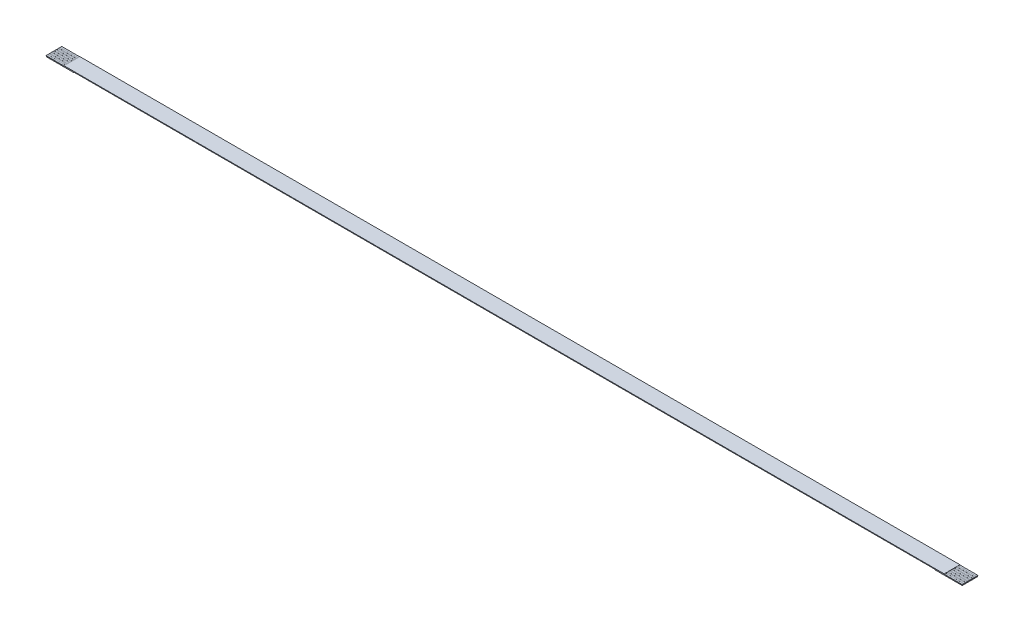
ISO-10303-21;
HEADER;
FILE_DESCRIPTION(('STEP AP214'),'2;1');
FILE_NAME('part.step','',(''),(''),'','','');
FILE_SCHEMA(('AUTOMOTIVE_DESIGN { 1 0 10303 214 1 1 1 1 }'));
ENDSEC;
DATA;
#1=APPLICATION_CONTEXT('core data for automotive mechanical design processes');
#2=APPLICATION_PROTOCOL_DEFINITION('international standard','automotive_design',2000,#1);
#3=PRODUCT_CONTEXT('',#1,'mechanical');
#4=PRODUCT('Part','Part','',(#3));
#5=PRODUCT_RELATED_PRODUCT_CATEGORY('part','',(#4));
#6=PRODUCT_DEFINITION_FORMATION('','',#4);
#7=PRODUCT_DEFINITION_CONTEXT('part definition',#1,'design');
#8=PRODUCT_DEFINITION('design','',#6,#7);
#9=PRODUCT_DEFINITION_SHAPE('','',#8);
#10=(LENGTH_UNIT() NAMED_UNIT(*) SI_UNIT(.MILLI.,.METRE.));
#11=(NAMED_UNIT(*) PLANE_ANGLE_UNIT() SI_UNIT($,.RADIAN.));
#12=(NAMED_UNIT(*) SI_UNIT($,.STERADIAN.) SOLID_ANGLE_UNIT());
#13=UNCERTAINTY_MEASURE_WITH_UNIT(LENGTH_MEASURE(1.E-05),#10,'distance_accuracy_value','');
#14=(GEOMETRIC_REPRESENTATION_CONTEXT(3) GLOBAL_UNCERTAINTY_ASSIGNED_CONTEXT((#13)) GLOBAL_UNIT_ASSIGNED_CONTEXT((#10,
#11,#12)) REPRESENTATION_CONTEXT('',''));
#15=CARTESIAN_POINT('',(0.,0.,0.));
#16=DIRECTION('',(0.,0.,1.));
#17=DIRECTION('',(1.,0.,0.));
#18=AXIS2_PLACEMENT_3D('',#15,#16,#17);
#19=CARTESIAN_POINT('',(0.,-0.15,-3.5));
#20=DIRECTION('',(0.,-1.,0.));
#21=DIRECTION('',(0.,0.,-1.));
#22=AXIS2_PLACEMENT_3D('',#19,#20,#21);
#23=PLANE('',#22);
#24=DIRECTION('',(0.,0.,1.));
#25=VECTOR('',#24,1.);
#26=CARTESIAN_POINT('',(0.,-0.15,0.));
#27=LINE('',#26,#25);
#28=CARTESIAN_POINT('',(0.,-0.15,-3.5));
#29=VERTEX_POINT('',#28);
#30=CARTESIAN_POINT('',(0.,-0.15,0.));
#31=VERTEX_POINT('',#30);
#32=EDGE_CURVE('E872',#29,#31,#27,.T.);
#33=ORIENTED_EDGE('',*,*,#32,.F.);
#34=DIRECTION('',(-1.,0.,0.));
#35=VECTOR('',#34,1.);
#36=CARTESIAN_POINT('',(0.,-0.15,-3.5));
#37=LINE('',#36,#35);
#38=CARTESIAN_POINT('',(203.,-0.15,-3.5));
#39=VERTEX_POINT('',#38);
#40=EDGE_CURVE('E882',#39,#29,#37,.T.);
#41=ORIENTED_EDGE('',*,*,#40,.F.);
#42=DIRECTION('',(0.,0.,-1.));
#43=VECTOR('',#42,1.);
#44=CARTESIAN_POINT('',(203.,-0.15,0.));
#45=LINE('',#44,#43);
#46=CARTESIAN_POINT('',(203.,-0.15,0.));
#47=VERTEX_POINT('',#46);
#48=EDGE_CURVE('E879',#47,#39,#45,.T.);
#49=ORIENTED_EDGE('',*,*,#48,.F.);
#50=DIRECTION('',(1.,0.,0.));
#51=VECTOR('',#50,1.);
#52=CARTESIAN_POINT('',(0.,-0.15,0.));
#53=LINE('',#52,#51);
#54=EDGE_CURVE('E875',#31,#47,#53,.T.);
#55=ORIENTED_EDGE('',*,*,#54,.F.);
#56=EDGE_LOOP('',(#33,#41,#49,#55));
#57=FACE_BOUND('',#56,.T.);
#58=DIRECTION('',(1.,0.,0.));
#59=VECTOR('',#58,1.);
#60=CARTESIAN_POINT('',(0.0500000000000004,-0.15,-3.45));
#61=LINE('',#60,#59);
#62=CARTESIAN_POINT('',(0.0500000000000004,-0.15,-3.45));
#63=VERTEX_POINT('',#62);
#64=CARTESIAN_POINT('',(6.05,-0.15,-3.45));
#65=VERTEX_POINT('',#64);
#66=EDGE_CURVE('E469',#63,#65,#61,.T.);
#67=ORIENTED_EDGE('',*,*,#66,.F.);
#68=DIRECTION('',(0.,0.,-1.));
#69=VECTOR('',#68,1.);
#70=CARTESIAN_POINT('',(0.05,-0.15,-0.05));
#71=LINE('',#70,#69);
#72=CARTESIAN_POINT('',(0.05,-0.15,-0.05));
#73=VERTEX_POINT('',#72);
#74=EDGE_CURVE('E466',#73,#63,#71,.T.);
#75=ORIENTED_EDGE('',*,*,#74,.F.);
#76=DIRECTION('',(-1.,0.,0.));
#77=VECTOR('',#76,1.);
#78=CARTESIAN_POINT('',(0.05,-0.15,-0.05));
#79=LINE('',#78,#77);
#80=CARTESIAN_POINT('',(6.05,-0.15,-0.0500000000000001));
#81=VERTEX_POINT('',#80);
#82=EDGE_CURVE('E478',#81,#73,#79,.T.);
#83=ORIENTED_EDGE('',*,*,#82,.F.);
#84=DIRECTION('',(0.,0.,1.));
#85=VECTOR('',#84,1.);
#86=CARTESIAN_POINT('',(6.05,-0.15,-0.05));
#87=LINE('',#86,#85);
#88=EDGE_CURVE('E486',#65,#81,#87,.T.);
#89=ORIENTED_EDGE('',*,*,#88,.F.);
#90=EDGE_LOOP('',(#67,#75,#83,#89));
#91=FACE_BOUND('',#90,.T.);
#92=DIRECTION('',(-1.,0.,0.));
#93=VECTOR('',#92,1.);
#94=CARTESIAN_POINT('',(202.95,-0.15,-0.05));
#95=LINE('',#94,#93);
#96=CARTESIAN_POINT('',(202.95,-0.15,-0.05));
#97=VERTEX_POINT('',#96);
#98=CARTESIAN_POINT('',(196.95,-0.15,-0.0500000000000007));
#99=VERTEX_POINT('',#98);
#100=EDGE_CURVE('E1734',#97,#99,#95,.T.);
#101=ORIENTED_EDGE('',*,*,#100,.F.);
#102=DIRECTION('',(0.,0.,1.));
#103=VECTOR('',#102,1.);
#104=CARTESIAN_POINT('',(202.95,-0.15,-0.05));
#105=LINE('',#104,#103);
#106=CARTESIAN_POINT('',(202.95,-0.15,-3.45));
#107=VERTEX_POINT('',#106);
#108=EDGE_CURVE('E464',#107,#97,#105,.T.);
#109=ORIENTED_EDGE('',*,*,#108,.F.);
#110=DIRECTION('',(1.,0.,0.));
#111=VECTOR('',#110,1.);
#112=CARTESIAN_POINT('',(202.95,-0.15,-3.45));
#113=LINE('',#112,#111);
#114=CARTESIAN_POINT('',(196.95,-0.15,-3.45));
#115=VERTEX_POINT('',#114);
#116=EDGE_CURVE('E460',#115,#107,#113,.T.);
#117=ORIENTED_EDGE('',*,*,#116,.F.);
#118=DIRECTION('',(0.,0.,-1.));
#119=VECTOR('',#118,1.);
#120=CARTESIAN_POINT('',(196.95,-0.15,-0.0500000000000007));
#121=LINE('',#120,#119);
#122=EDGE_CURVE('E1731',#99,#115,#121,.T.);
#123=ORIENTED_EDGE('',*,*,#122,.F.);
#124=EDGE_LOOP('',(#101,#109,#117,#123));
#125=FACE_BOUND('',#124,.T.);
#126=ADVANCED_FACE('F39',(#57,#91,#125),#23,.T.);
#127=CARTESIAN_POINT('',(199.,-0.05,4.));
#128=DIRECTION('',(0.,1.,0.));
#129=DIRECTION('',(0.,0.,1.));
#130=AXIS2_PLACEMENT_3D('',#127,#128,#129);
#131=PLANE('',#130);
#132=DIRECTION('',(0.,0.,1.));
#133=VECTOR('',#132,1.);
#134=CARTESIAN_POINT('',(199.,-0.05,-7.5));
#135=LINE('',#134,#133);
#136=CARTESIAN_POINT('',(199.,-0.05,-3.5));
#137=VERTEX_POINT('',#136);
#138=CARTESIAN_POINT('',(199.,-0.05,0.));
#139=VERTEX_POINT('',#138);
#140=EDGE_CURVE('E845',#137,#139,#135,.T.);
#141=ORIENTED_EDGE('',*,*,#140,.T.);
#142=DIRECTION('',(-1.,0.,0.));
#143=VECTOR('',#142,1.);
#144=CARTESIAN_POINT('',(0.,-0.05,0.));
#145=LINE('',#144,#143);
#146=CARTESIAN_POINT('',(203.,-0.05,0.));
#147=VERTEX_POINT('',#146);
#148=EDGE_CURVE('E11',#147,#139,#145,.T.);
#149=ORIENTED_EDGE('',*,*,#148,.F.);
#150=DIRECTION('',(0.,0.,1.));
#151=VECTOR('',#150,1.);
#152=CARTESIAN_POINT('',(203.,-0.05,0.));
#153=LINE('',#152,#151);
#154=CARTESIAN_POINT('',(203.,-0.05,-3.5));
#155=VERTEX_POINT('',#154);
#156=EDGE_CURVE('E852',#155,#147,#153,.T.);
#157=ORIENTED_EDGE('',*,*,#156,.F.);
#158=DIRECTION('',(1.,0.,0.));
#159=VECTOR('',#158,1.);
#160=CARTESIAN_POINT('',(0.,-0.05,-3.5));
#161=LINE('',#160,#159);
#162=EDGE_CURVE('E855',#137,#155,#161,.T.);
#163=ORIENTED_EDGE('',*,*,#162,.F.);
#164=EDGE_LOOP('',(#141,#149,#157,#163));
#165=FACE_BOUND('',#164,.T.);
#166=DIRECTION('',(1.,0.,0.));
#167=VECTOR('',#166,1.);
#168=CARTESIAN_POINT('',(199.01,-0.05,-2.84999999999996));
#169=LINE('',#168,#167);
#170=CARTESIAN_POINT('',(199.01,-0.05,-2.84999999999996));
#171=VERTEX_POINT('',#170);
#172=CARTESIAN_POINT('',(202.99,-0.05,-2.84999999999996));
#173=VERTEX_POINT('',#172);
#174=EDGE_CURVE('E656',#171,#173,#169,.T.);
#175=ORIENTED_EDGE('',*,*,#174,.F.);
#176=DIRECTION('',(0.,0.,1.));
#177=VECTOR('',#176,1.);
#178=CARTESIAN_POINT('',(199.01,-0.05,-3.14999999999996));
#179=LINE('',#178,#177);
#180=CARTESIAN_POINT('',(199.01,-0.05,-3.14999999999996));
#181=VERTEX_POINT('',#180);
#182=EDGE_CURVE('E642',#181,#171,#179,.T.);
#183=ORIENTED_EDGE('',*,*,#182,.F.);
#184=DIRECTION('',(-1.,0.,0.));
#185=VECTOR('',#184,1.);
#186=CARTESIAN_POINT('',(199.01,-0.05,-3.14999999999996));
#187=LINE('',#186,#185);
#188=CARTESIAN_POINT('',(202.99,-0.05,-3.14999999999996));
#189=VERTEX_POINT('',#188);
#190=EDGE_CURVE('E647',#189,#181,#187,.T.);
#191=ORIENTED_EDGE('',*,*,#190,.F.);
#192=DIRECTION('',(0.,0.,-1.));
#193=VECTOR('',#192,1.);
#194=CARTESIAN_POINT('',(202.99,-0.05,-3.14999999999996));
#195=LINE('',#194,#193);
#196=EDGE_CURVE('E658',#173,#189,#195,.T.);
#197=ORIENTED_EDGE('',*,*,#196,.F.);
#198=EDGE_LOOP('',(#175,#183,#191,#197));
#199=FACE_BOUND('',#198,.T.);
#200=DIRECTION('',(1.,0.,0.));
#201=VECTOR('',#200,1.);
#202=CARTESIAN_POINT('',(199.01,-0.05,-2.34999999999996));
#203=LINE('',#202,#201);
#204=CARTESIAN_POINT('',(199.01,-0.05,-2.34999999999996));
#205=VERTEX_POINT('',#204);
#206=CARTESIAN_POINT('',(202.99,-0.05,-2.34999999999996));
#207=VERTEX_POINT('',#206);
#208=EDGE_CURVE('E627',#205,#207,#203,.T.);
#209=ORIENTED_EDGE('',*,*,#208,.F.);
#210=DIRECTION('',(0.,0.,1.));
#211=VECTOR('',#210,1.);
#212=CARTESIAN_POINT('',(199.01,-0.05,-2.64999999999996));
#213=LINE('',#212,#211);
#214=CARTESIAN_POINT('',(199.01,-0.05,-2.64999999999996));
#215=VERTEX_POINT('',#214);
#216=EDGE_CURVE('E613',#215,#205,#213,.T.);
#217=ORIENTED_EDGE('',*,*,#216,.F.);
#218=DIRECTION('',(-1.,0.,0.));
#219=VECTOR('',#218,1.);
#220=CARTESIAN_POINT('',(199.01,-0.05,-2.64999999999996));
#221=LINE('',#220,#219);
#222=CARTESIAN_POINT('',(202.99,-0.05,-2.64999999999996));
#223=VERTEX_POINT('',#222);
#224=EDGE_CURVE('E618',#223,#215,#221,.T.);
#225=ORIENTED_EDGE('',*,*,#224,.F.);
#226=DIRECTION('',(0.,0.,-1.));
#227=VECTOR('',#226,1.);
#228=CARTESIAN_POINT('',(202.99,-0.05,-2.64999999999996));
#229=LINE('',#228,#227);
#230=EDGE_CURVE('E629',#207,#223,#229,.T.);
#231=ORIENTED_EDGE('',*,*,#230,.F.);
#232=EDGE_LOOP('',(#209,#217,#225,#231));
#233=FACE_BOUND('',#232,.T.);
#234=DIRECTION('',(1.,0.,0.));
#235=VECTOR('',#234,1.);
#236=CARTESIAN_POINT('',(199.01,-0.05,-1.84999999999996));
#237=LINE('',#236,#235);
#238=CARTESIAN_POINT('',(199.01,-0.05,-1.84999999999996));
#239=VERTEX_POINT('',#238);
#240=CARTESIAN_POINT('',(202.99,-0.05,-1.84999999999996));
#241=VERTEX_POINT('',#240);
#242=EDGE_CURVE('E598',#239,#241,#237,.T.);
#243=ORIENTED_EDGE('',*,*,#242,.F.);
#244=DIRECTION('',(0.,0.,1.));
#245=VECTOR('',#244,1.);
#246=CARTESIAN_POINT('',(199.01,-0.05,-2.14999999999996));
#247=LINE('',#246,#245);
#248=CARTESIAN_POINT('',(199.01,-0.05,-2.14999999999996));
#249=VERTEX_POINT('',#248);
#250=EDGE_CURVE('E584',#249,#239,#247,.T.);
#251=ORIENTED_EDGE('',*,*,#250,.F.);
#252=DIRECTION('',(-1.,0.,0.));
#253=VECTOR('',#252,1.);
#254=CARTESIAN_POINT('',(199.01,-0.05,-2.14999999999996));
#255=LINE('',#254,#253);
#256=CARTESIAN_POINT('',(202.99,-0.05,-2.14999999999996));
#257=VERTEX_POINT('',#256);
#258=EDGE_CURVE('E589',#257,#249,#255,.T.);
#259=ORIENTED_EDGE('',*,*,#258,.F.);
#260=DIRECTION('',(0.,0.,-1.));
#261=VECTOR('',#260,1.);
#262=CARTESIAN_POINT('',(202.99,-0.05,-2.14999999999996));
#263=LINE('',#262,#261);
#264=EDGE_CURVE('E600',#241,#257,#263,.T.);
#265=ORIENTED_EDGE('',*,*,#264,.F.);
#266=EDGE_LOOP('',(#243,#251,#259,#265));
#267=FACE_BOUND('',#266,.T.);
#268=DIRECTION('',(1.,0.,0.));
#269=VECTOR('',#268,1.);
#270=CARTESIAN_POINT('',(199.01,-0.05,-1.34999999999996));
#271=LINE('',#270,#269);
#272=CARTESIAN_POINT('',(199.01,-0.05,-1.34999999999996));
#273=VERTEX_POINT('',#272);
#274=CARTESIAN_POINT('',(202.99,-0.05,-1.34999999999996));
#275=VERTEX_POINT('',#274);
#276=EDGE_CURVE('E569',#273,#275,#271,.T.);
#277=ORIENTED_EDGE('',*,*,#276,.F.);
#278=DIRECTION('',(0.,0.,1.));
#279=VECTOR('',#278,1.);
#280=CARTESIAN_POINT('',(199.01,-0.05,-1.64999999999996));
#281=LINE('',#280,#279);
#282=CARTESIAN_POINT('',(199.01,-0.05,-1.64999999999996));
#283=VERTEX_POINT('',#282);
#284=EDGE_CURVE('E555',#283,#273,#281,.T.);
#285=ORIENTED_EDGE('',*,*,#284,.F.);
#286=DIRECTION('',(-1.,0.,0.));
#287=VECTOR('',#286,1.);
#288=CARTESIAN_POINT('',(199.01,-0.05,-1.64999999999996));
#289=LINE('',#288,#287);
#290=CARTESIAN_POINT('',(202.99,-0.05,-1.64999999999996));
#291=VERTEX_POINT('',#290);
#292=EDGE_CURVE('E560',#291,#283,#289,.T.);
#293=ORIENTED_EDGE('',*,*,#292,.F.);
#294=DIRECTION('',(0.,0.,-1.));
#295=VECTOR('',#294,1.);
#296=CARTESIAN_POINT('',(202.99,-0.05,-1.64999999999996));
#297=LINE('',#296,#295);
#298=EDGE_CURVE('E571',#275,#291,#297,.T.);
#299=ORIENTED_EDGE('',*,*,#298,.F.);
#300=EDGE_LOOP('',(#277,#285,#293,#299));
#301=FACE_BOUND('',#300,.T.);
#302=DIRECTION('',(1.,0.,0.));
#303=VECTOR('',#302,1.);
#304=CARTESIAN_POINT('',(199.01,-0.05,-0.849999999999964));
#305=LINE('',#304,#303);
#306=CARTESIAN_POINT('',(199.01,-0.05,-0.849999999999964));
#307=VERTEX_POINT('',#306);
#308=CARTESIAN_POINT('',(202.99,-0.05,-0.849999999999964));
#309=VERTEX_POINT('',#308);
#310=EDGE_CURVE('E540',#307,#309,#305,.T.);
#311=ORIENTED_EDGE('',*,*,#310,.F.);
#312=DIRECTION('',(0.,0.,1.));
#313=VECTOR('',#312,1.);
#314=CARTESIAN_POINT('',(199.01,-0.05,-1.14999999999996));
#315=LINE('',#314,#313);
#316=CARTESIAN_POINT('',(199.01,-0.05,-1.14999999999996));
#317=VERTEX_POINT('',#316);
#318=EDGE_CURVE('E526',#317,#307,#315,.T.);
#319=ORIENTED_EDGE('',*,*,#318,.F.);
#320=DIRECTION('',(-1.,0.,0.));
#321=VECTOR('',#320,1.);
#322=CARTESIAN_POINT('',(199.01,-0.05,-1.14999999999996));
#323=LINE('',#322,#321);
#324=CARTESIAN_POINT('',(202.99,-0.05,-1.14999999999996));
#325=VERTEX_POINT('',#324);
#326=EDGE_CURVE('E531',#325,#317,#323,.T.);
#327=ORIENTED_EDGE('',*,*,#326,.F.);
#328=DIRECTION('',(0.,0.,-1.));
#329=VECTOR('',#328,1.);
#330=CARTESIAN_POINT('',(202.99,-0.05,-1.14999999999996));
#331=LINE('',#330,#329);
#332=EDGE_CURVE('E542',#309,#325,#331,.T.);
#333=ORIENTED_EDGE('',*,*,#332,.F.);
#334=EDGE_LOOP('',(#311,#319,#327,#333));
#335=FACE_BOUND('',#334,.T.);
#336=DIRECTION('',(1.,0.,0.));
#337=VECTOR('',#336,1.);
#338=CARTESIAN_POINT('',(199.01,-0.05,-0.349999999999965));
#339=LINE('',#338,#337);
#340=CARTESIAN_POINT('',(199.01,-0.05,-0.349999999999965));
#341=VERTEX_POINT('',#340);
#342=CARTESIAN_POINT('',(202.99,-0.05,-0.349999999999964));
#343=VERTEX_POINT('',#342);
#344=EDGE_CURVE('E511',#341,#343,#339,.T.);
#345=ORIENTED_EDGE('',*,*,#344,.F.);
#346=DIRECTION('',(0.,0.,1.));
#347=VECTOR('',#346,1.);
#348=CARTESIAN_POINT('',(199.01,-0.05,-0.649999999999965));
#349=LINE('',#348,#347);
#350=CARTESIAN_POINT('',(199.01,-0.05,-0.649999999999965));
#351=VERTEX_POINT('',#350);
#352=EDGE_CURVE('E497',#351,#341,#349,.T.);
#353=ORIENTED_EDGE('',*,*,#352,.F.);
#354=DIRECTION('',(-1.,0.,0.));
#355=VECTOR('',#354,1.);
#356=CARTESIAN_POINT('',(199.01,-0.05,-0.649999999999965));
#357=LINE('',#356,#355);
#358=CARTESIAN_POINT('',(202.99,-0.05,-0.649999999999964));
#359=VERTEX_POINT('',#358);
#360=EDGE_CURVE('E502',#359,#351,#357,.T.);
#361=ORIENTED_EDGE('',*,*,#360,.F.);
#362=DIRECTION('',(0.,0.,-1.));
#363=VECTOR('',#362,1.);
#364=CARTESIAN_POINT('',(202.99,-0.05,-0.649999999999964));
#365=LINE('',#364,#363);
#366=EDGE_CURVE('E513',#343,#359,#365,.T.);
#367=ORIENTED_EDGE('',*,*,#366,.F.);
#368=EDGE_LOOP('',(#345,#353,#361,#367));
#369=FACE_BOUND('',#368,.T.);
#370=ADVANCED_FACE('F936',(#165,#199,#233,#267,#301,#335,#369),#131,.T.);
#371=CARTESIAN_POINT('',(-4.,-0.05,4.));
#372=DIRECTION('',(0.,1.,0.));
#373=DIRECTION('',(0.,0.,1.));
#374=AXIS2_PLACEMENT_3D('',#371,#372,#373);
#375=PLANE('',#374);
#376=DIRECTION('',(0.,0.,-1.));
#377=VECTOR('',#376,1.);
#378=CARTESIAN_POINT('',(0.,-0.05,0.));
#379=LINE('',#378,#377);
#380=CARTESIAN_POINT('',(0.,-0.05,0.));
#381=VERTEX_POINT('',#380);
#382=CARTESIAN_POINT('',(0.,-0.05,-3.5));
#383=VERTEX_POINT('',#382);
#384=EDGE_CURVE('E865',#381,#383,#379,.T.);
#385=ORIENTED_EDGE('',*,*,#384,.F.);
#386=DIRECTION('',(-1.,0.,0.));
#387=VECTOR('',#386,1.);
#388=CARTESIAN_POINT('',(0.,-0.05,0.));
#389=LINE('',#388,#387);
#390=CARTESIAN_POINT('',(4.,-0.05,0.));
#391=VERTEX_POINT('',#390);
#392=EDGE_CURVE('E903',#391,#381,#389,.T.);
#393=ORIENTED_EDGE('',*,*,#392,.F.);
#394=DIRECTION('',(0.,0.,-1.));
#395=VECTOR('',#394,1.);
#396=CARTESIAN_POINT('',(4.,-0.05,-7.5));
#397=LINE('',#396,#395);
#398=CARTESIAN_POINT('',(4.,-0.05,-3.5));
#399=VERTEX_POINT('',#398);
#400=EDGE_CURVE('E858',#391,#399,#397,.T.);
#401=ORIENTED_EDGE('',*,*,#400,.T.);
#402=DIRECTION('',(1.,0.,0.));
#403=VECTOR('',#402,1.);
#404=CARTESIAN_POINT('',(0.,-0.05,-3.5));
#405=LINE('',#404,#403);
#406=EDGE_CURVE('E868',#383,#399,#405,.T.);
#407=ORIENTED_EDGE('',*,*,#406,.F.);
#408=EDGE_LOOP('',(#385,#393,#401,#407));
#409=FACE_BOUND('',#408,.T.);
#410=DIRECTION('',(1.,0.,0.));
#411=VECTOR('',#410,1.);
#412=CARTESIAN_POINT('',(0.0100000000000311,-0.05,-2.85));
#413=LINE('',#412,#411);
#414=CARTESIAN_POINT('',(0.0100000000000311,-0.05,-2.85));
#415=VERTEX_POINT('',#414);
#416=CARTESIAN_POINT('',(3.99,-0.05,-2.85));
#417=VERTEX_POINT('',#416);
#418=EDGE_CURVE('E830',#415,#417,#413,.T.);
#419=ORIENTED_EDGE('',*,*,#418,.F.);
#420=DIRECTION('',(0.,0.,1.));
#421=VECTOR('',#420,1.);
#422=CARTESIAN_POINT('',(0.0100000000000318,-0.05,-3.15));
#423=LINE('',#422,#421);
#424=CARTESIAN_POINT('',(0.0100000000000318,-0.05,-3.15));
#425=VERTEX_POINT('',#424);
#426=EDGE_CURVE('E816',#425,#415,#423,.T.);
#427=ORIENTED_EDGE('',*,*,#426,.F.);
#428=DIRECTION('',(-1.,0.,0.));
#429=VECTOR('',#428,1.);
#430=CARTESIAN_POINT('',(0.0100000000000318,-0.05,-3.15));
#431=LINE('',#430,#429);
#432=CARTESIAN_POINT('',(3.99,-0.05,-3.15));
#433=VERTEX_POINT('',#432);
#434=EDGE_CURVE('E821',#433,#425,#431,.T.);
#435=ORIENTED_EDGE('',*,*,#434,.F.);
#436=DIRECTION('',(0.,0.,-1.));
#437=VECTOR('',#436,1.);
#438=CARTESIAN_POINT('',(3.99,-0.05,-3.15));
#439=LINE('',#438,#437);
#440=EDGE_CURVE('E832',#417,#433,#439,.T.);
#441=ORIENTED_EDGE('',*,*,#440,.F.);
#442=EDGE_LOOP('',(#419,#427,#435,#441));
#443=FACE_BOUND('',#442,.T.);
#444=DIRECTION('',(1.,0.,0.));
#445=VECTOR('',#444,1.);
#446=CARTESIAN_POINT('',(0.0100000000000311,-0.05,-2.35));
#447=LINE('',#446,#445);
#448=CARTESIAN_POINT('',(0.0100000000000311,-0.05,-2.35));
#449=VERTEX_POINT('',#448);
#450=CARTESIAN_POINT('',(3.99,-0.05,-2.35));
#451=VERTEX_POINT('',#450);
#452=EDGE_CURVE('E801',#449,#451,#447,.T.);
#453=ORIENTED_EDGE('',*,*,#452,.F.);
#454=DIRECTION('',(0.,0.,1.));
#455=VECTOR('',#454,1.);
#456=CARTESIAN_POINT('',(0.0100000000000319,-0.05,-2.65));
#457=LINE('',#456,#455);
#458=CARTESIAN_POINT('',(0.0100000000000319,-0.05,-2.65));
#459=VERTEX_POINT('',#458);
#460=EDGE_CURVE('E787',#459,#449,#457,.T.);
#461=ORIENTED_EDGE('',*,*,#460,.F.);
#462=DIRECTION('',(-1.,0.,0.));
#463=VECTOR('',#462,1.);
#464=CARTESIAN_POINT('',(0.0100000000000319,-0.05,-2.65));
#465=LINE('',#464,#463);
#466=CARTESIAN_POINT('',(3.99,-0.05,-2.65));
#467=VERTEX_POINT('',#466);
#468=EDGE_CURVE('E792',#467,#459,#465,.T.);
#469=ORIENTED_EDGE('',*,*,#468,.F.);
#470=DIRECTION('',(0.,0.,-1.));
#471=VECTOR('',#470,1.);
#472=CARTESIAN_POINT('',(3.99,-0.05,-2.65));
#473=LINE('',#472,#471);
#474=EDGE_CURVE('E803',#451,#467,#473,.T.);
#475=ORIENTED_EDGE('',*,*,#474,.F.);
#476=EDGE_LOOP('',(#453,#461,#469,#475));
#477=FACE_BOUND('',#476,.T.);
#478=DIRECTION('',(1.,0.,0.));
#479=VECTOR('',#478,1.);
#480=CARTESIAN_POINT('',(0.0100000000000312,-0.05,-1.85));
#481=LINE('',#480,#479);
#482=CARTESIAN_POINT('',(0.0100000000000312,-0.05,-1.85));
#483=VERTEX_POINT('',#482);
#484=CARTESIAN_POINT('',(3.99,-0.05,-1.85));
#485=VERTEX_POINT('',#484);
#486=EDGE_CURVE('E772',#483,#485,#481,.T.);
#487=ORIENTED_EDGE('',*,*,#486,.F.);
#488=DIRECTION('',(0.,0.,1.));
#489=VECTOR('',#488,1.);
#490=CARTESIAN_POINT('',(0.0100000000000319,-0.05,-2.15));
#491=LINE('',#490,#489);
#492=CARTESIAN_POINT('',(0.0100000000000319,-0.05,-2.15));
#493=VERTEX_POINT('',#492);
#494=EDGE_CURVE('E758',#493,#483,#491,.T.);
#495=ORIENTED_EDGE('',*,*,#494,.F.);
#496=DIRECTION('',(-1.,0.,0.));
#497=VECTOR('',#496,1.);
#498=CARTESIAN_POINT('',(0.0100000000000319,-0.05,-2.15));
#499=LINE('',#498,#497);
#500=CARTESIAN_POINT('',(3.99,-0.05,-2.15));
#501=VERTEX_POINT('',#500);
#502=EDGE_CURVE('E763',#501,#493,#499,.T.);
#503=ORIENTED_EDGE('',*,*,#502,.F.);
#504=DIRECTION('',(0.,0.,-1.));
#505=VECTOR('',#504,1.);
#506=CARTESIAN_POINT('',(3.99,-0.05,-2.15));
#507=LINE('',#506,#505);
#508=EDGE_CURVE('E774',#485,#501,#507,.T.);
#509=ORIENTED_EDGE('',*,*,#508,.F.);
#510=EDGE_LOOP('',(#487,#495,#503,#509));
#511=FACE_BOUND('',#510,.T.);
#512=DIRECTION('',(1.,0.,0.));
#513=VECTOR('',#512,1.);
#514=CARTESIAN_POINT('',(0.0100000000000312,-0.05,-1.35));
#515=LINE('',#514,#513);
#516=CARTESIAN_POINT('',(0.0100000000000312,-0.05,-1.35));
#517=VERTEX_POINT('',#516);
#518=CARTESIAN_POINT('',(3.99,-0.05,-1.35));
#519=VERTEX_POINT('',#518);
#520=EDGE_CURVE('E743',#517,#519,#515,.T.);
#521=ORIENTED_EDGE('',*,*,#520,.F.);
#522=DIRECTION('',(0.,0.,1.));
#523=VECTOR('',#522,1.);
#524=CARTESIAN_POINT('',(0.010000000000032,-0.05,-1.65));
#525=LINE('',#524,#523);
#526=CARTESIAN_POINT('',(0.010000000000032,-0.05,-1.65));
#527=VERTEX_POINT('',#526);
#528=EDGE_CURVE('E729',#527,#517,#525,.T.);
#529=ORIENTED_EDGE('',*,*,#528,.F.);
#530=DIRECTION('',(-1.,0.,0.));
#531=VECTOR('',#530,1.);
#532=CARTESIAN_POINT('',(0.010000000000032,-0.05,-1.65));
#533=LINE('',#532,#531);
#534=CARTESIAN_POINT('',(3.99,-0.05,-1.65));
#535=VERTEX_POINT('',#534);
#536=EDGE_CURVE('E734',#535,#527,#533,.T.);
#537=ORIENTED_EDGE('',*,*,#536,.F.);
#538=DIRECTION('',(0.,0.,-1.));
#539=VECTOR('',#538,1.);
#540=CARTESIAN_POINT('',(3.99,-0.05,-1.65));
#541=LINE('',#540,#539);
#542=EDGE_CURVE('E745',#519,#535,#541,.T.);
#543=ORIENTED_EDGE('',*,*,#542,.F.);
#544=EDGE_LOOP('',(#521,#529,#537,#543));
#545=FACE_BOUND('',#544,.T.);
#546=DIRECTION('',(1.,0.,0.));
#547=VECTOR('',#546,1.);
#548=CARTESIAN_POINT('',(0.0100000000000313,-0.05,-0.850000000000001));
#549=LINE('',#548,#547);
#550=CARTESIAN_POINT('',(0.0100000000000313,-0.05,-0.850000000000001));
#551=VERTEX_POINT('',#550);
#552=CARTESIAN_POINT('',(3.99,-0.05,-0.85));
#553=VERTEX_POINT('',#552);
#554=EDGE_CURVE('E714',#551,#553,#549,.T.);
#555=ORIENTED_EDGE('',*,*,#554,.F.);
#556=DIRECTION('',(0.,0.,1.));
#557=VECTOR('',#556,1.);
#558=CARTESIAN_POINT('',(0.010000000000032,-0.05,-1.15));
#559=LINE('',#558,#557);
#560=CARTESIAN_POINT('',(0.010000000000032,-0.05,-1.15));
#561=VERTEX_POINT('',#560);
#562=EDGE_CURVE('E700',#561,#551,#559,.T.);
#563=ORIENTED_EDGE('',*,*,#562,.F.);
#564=DIRECTION('',(-1.,0.,0.));
#565=VECTOR('',#564,1.);
#566=CARTESIAN_POINT('',(0.010000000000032,-0.05,-1.15));
#567=LINE('',#566,#565);
#568=CARTESIAN_POINT('',(3.99,-0.05,-1.15));
#569=VERTEX_POINT('',#568);
#570=EDGE_CURVE('E705',#569,#561,#567,.T.);
#571=ORIENTED_EDGE('',*,*,#570,.F.);
#572=DIRECTION('',(0.,0.,-1.));
#573=VECTOR('',#572,1.);
#574=CARTESIAN_POINT('',(3.99,-0.05,-1.15));
#575=LINE('',#574,#573);
#576=EDGE_CURVE('E716',#553,#569,#575,.T.);
#577=ORIENTED_EDGE('',*,*,#576,.F.);
#578=EDGE_LOOP('',(#555,#563,#571,#577));
#579=FACE_BOUND('',#578,.T.);
#580=DIRECTION('',(1.,0.,0.));
#581=VECTOR('',#580,1.);
#582=CARTESIAN_POINT('',(0.010000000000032,-0.05,-0.350000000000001));
#583=LINE('',#582,#581);
#584=CARTESIAN_POINT('',(0.010000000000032,-0.05,-0.350000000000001));
#585=VERTEX_POINT('',#584);
#586=CARTESIAN_POINT('',(3.99,-0.05,-0.35));
#587=VERTEX_POINT('',#586);
#588=EDGE_CURVE('E685',#585,#587,#583,.T.);
#589=ORIENTED_EDGE('',*,*,#588,.F.);
#590=DIRECTION('',(0.,0.,1.));
#591=VECTOR('',#590,1.);
#592=CARTESIAN_POINT('',(0.0100000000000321,-0.05,-0.650000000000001));
#593=LINE('',#592,#591);
#594=CARTESIAN_POINT('',(0.0100000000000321,-0.05,-0.650000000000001));
#595=VERTEX_POINT('',#594);
#596=EDGE_CURVE('E671',#595,#585,#593,.T.);
#597=ORIENTED_EDGE('',*,*,#596,.F.);
#598=DIRECTION('',(-1.,0.,0.));
#599=VECTOR('',#598,1.);
#600=CARTESIAN_POINT('',(0.0100000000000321,-0.05,-0.650000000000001));
#601=LINE('',#600,#599);
#602=CARTESIAN_POINT('',(3.99,-0.05,-0.650000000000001));
#603=VERTEX_POINT('',#602);
#604=EDGE_CURVE('E676',#603,#595,#601,.T.);
#605=ORIENTED_EDGE('',*,*,#604,.F.);
#606=DIRECTION('',(0.,0.,-1.));
#607=VECTOR('',#606,1.);
#608=CARTESIAN_POINT('',(3.99,-0.05,-0.65));
#609=LINE('',#608,#607);
#610=EDGE_CURVE('E687',#587,#603,#609,.T.);
#611=ORIENTED_EDGE('',*,*,#610,.F.);
#612=EDGE_LOOP('',(#589,#597,#605,#611));
#613=FACE_BOUND('',#612,.T.);
#614=ADVANCED_FACE('F922',(#409,#443,#477,#511,#545,#579,#613),#375,.T.);
#615=CARTESIAN_POINT('',(203.,-0.15,0.));
#616=DIRECTION('',(1.,0.,0.));
#617=DIRECTION('',(0.,0.,-1.));
#618=AXIS2_PLACEMENT_3D('',#615,#616,#617);
#619=PLANE('',#618);
#620=DIRECTION('',(0.,1.,0.));
#621=VECTOR('',#620,1.);
#622=CARTESIAN_POINT('',(203.,-0.15,-3.5));
#623=LINE('',#622,#621);
#624=EDGE_CURVE('E893',#39,#155,#623,.T.);
#625=ORIENTED_EDGE('',*,*,#624,.T.);
#626=ORIENTED_EDGE('',*,*,#156,.T.);
#627=DIRECTION('',(0.,1.,0.));
#628=VECTOR('',#627,1.);
#629=CARTESIAN_POINT('',(203.,-0.15,0.));
#630=LINE('',#629,#628);
#631=EDGE_CURVE('E896',#47,#147,#630,.T.);
#632=ORIENTED_EDGE('',*,*,#631,.F.);
#633=ORIENTED_EDGE('',*,*,#48,.T.);
#634=EDGE_LOOP('',(#625,#626,#632,#633));
#635=FACE_BOUND('',#634,.T.);
#636=ADVANCED_FACE('F934',(#635),#619,.T.);
#637=CARTESIAN_POINT('',(0.,-0.15,0.));
#638=DIRECTION('',(-1.,0.,0.));
#639=DIRECTION('',(0.,0.,1.));
#640=AXIS2_PLACEMENT_3D('',#637,#638,#639);
#641=PLANE('',#640);
#642=DIRECTION('',(0.,1.,0.));
#643=VECTOR('',#642,1.);
#644=CARTESIAN_POINT('',(0.,-0.15,0.));
#645=LINE('',#644,#643);
#646=EDGE_CURVE('E885',#31,#381,#645,.T.);
#647=ORIENTED_EDGE('',*,*,#646,.T.);
#648=ORIENTED_EDGE('',*,*,#384,.T.);
#649=DIRECTION('',(0.,1.,0.));
#650=VECTOR('',#649,1.);
#651=CARTESIAN_POINT('',(0.,-0.15,-3.5));
#652=LINE('',#651,#650);
#653=EDGE_CURVE('E889',#29,#383,#652,.T.);
#654=ORIENTED_EDGE('',*,*,#653,.F.);
#655=ORIENTED_EDGE('',*,*,#32,.T.);
#656=EDGE_LOOP('',(#647,#648,#654,#655));
#657=FACE_BOUND('',#656,.T.);
#658=ADVANCED_FACE('F41',(#657),#641,.T.);
#659=CARTESIAN_POINT('',(0.,-0.15,-3.5));
#660=DIRECTION('',(0.,0.,-1.));
#661=DIRECTION('',(-1.,0.,0.));
#662=AXIS2_PLACEMENT_3D('',#659,#660,#661);
#663=PLANE('',#662);
#664=DIRECTION('',(0.,1.,0.));
#665=VECTOR('',#664,1.);
#666=CARTESIAN_POINT('',(199.,-0.15,-3.5));
#667=LINE('',#666,#665);
#668=CARTESIAN_POINT('',(199.,0.,-3.5));
#669=VERTEX_POINT('',#668);
#670=EDGE_CURVE('E850',#137,#669,#667,.T.);
#671=ORIENTED_EDGE('',*,*,#670,.F.);
#672=ORIENTED_EDGE('',*,*,#162,.T.);
#673=ORIENTED_EDGE('',*,*,#624,.F.);
#674=ORIENTED_EDGE('',*,*,#40,.T.);
#675=ORIENTED_EDGE('',*,*,#653,.T.);
#676=ORIENTED_EDGE('',*,*,#406,.T.);
#677=DIRECTION('',(0.,-1.,0.));
#678=VECTOR('',#677,1.);
#679=CARTESIAN_POINT('',(4.,-0.15,-3.5));
#680=LINE('',#679,#678);
#681=CARTESIAN_POINT('',(4.,0.,-3.5));
#682=VERTEX_POINT('',#681);
#683=EDGE_CURVE('E863',#682,#399,#680,.T.);
#684=ORIENTED_EDGE('',*,*,#683,.F.);
#685=DIRECTION('',(-1.,0.,0.));
#686=VECTOR('',#685,1.);
#687=CARTESIAN_POINT('',(0.,0.,-3.5));
#688=LINE('',#687,#686);
#689=EDGE_CURVE('E876',#669,#682,#688,.T.);
#690=ORIENTED_EDGE('',*,*,#689,.F.);
#691=EDGE_LOOP('',(#671,#672,#673,#674,#675,#676,#684,#690));
#692=FACE_BOUND('',#691,.T.);
#693=ADVANCED_FACE('F916',(#692),#663,.T.);
#694=CARTESIAN_POINT('',(0.,-0.15,0.));
#695=DIRECTION('',(0.,0.,1.));
#696=DIRECTION('',(1.,0.,0.));
#697=AXIS2_PLACEMENT_3D('',#694,#695,#696);
#698=PLANE('',#697);
#699=DIRECTION('',(0.,-1.,0.));
#700=VECTOR('',#699,1.);
#701=CARTESIAN_POINT('',(199.,-0.15,0.));
#702=LINE('',#701,#700);
#703=CARTESIAN_POINT('',(199.,0.,0.));
#704=VERTEX_POINT('',#703);
#705=EDGE_CURVE('E848',#704,#139,#702,.T.);
#706=ORIENTED_EDGE('',*,*,#705,.F.);
#707=DIRECTION('',(1.,0.,0.));
#708=VECTOR('',#707,1.);
#709=CARTESIAN_POINT('',(0.,0.,0.));
#710=LINE('',#709,#708);
#711=CARTESIAN_POINT('',(4.,0.,0.));
#712=VERTEX_POINT('',#711);
#713=EDGE_CURVE('E871',#712,#704,#710,.T.);
#714=ORIENTED_EDGE('',*,*,#713,.F.);
#715=DIRECTION('',(0.,1.,0.));
#716=VECTOR('',#715,1.);
#717=CARTESIAN_POINT('',(4.,-0.15,0.));
#718=LINE('',#717,#716);
#719=EDGE_CURVE('E861',#391,#712,#718,.T.);
#720=ORIENTED_EDGE('',*,*,#719,.F.);
#721=ORIENTED_EDGE('',*,*,#392,.T.);
#722=ORIENTED_EDGE('',*,*,#646,.F.);
#723=ORIENTED_EDGE('',*,*,#54,.T.);
#724=ORIENTED_EDGE('',*,*,#631,.T.);
#725=ORIENTED_EDGE('',*,*,#148,.T.);
#726=EDGE_LOOP('',(#706,#714,#720,#721,#722,#723,#724,#725));
#727=FACE_BOUND('',#726,.T.);
#728=ADVANCED_FACE('F925',(#727),#698,.T.);
#729=CARTESIAN_POINT('',(0.,0.,-3.5));
#730=DIRECTION('',(0.,-1.,0.));
#731=DIRECTION('',(0.,0.,-1.));
#732=AXIS2_PLACEMENT_3D('',#729,#730,#731);
#733=PLANE('',#732);
#734=ORIENTED_EDGE('',*,*,#713,.T.);
#735=DIRECTION('',(0.,0.,-1.));
#736=VECTOR('',#735,1.);
#737=CARTESIAN_POINT('',(199.,0.,-3.5));
#738=LINE('',#737,#736);
#739=EDGE_CURVE('E47',#704,#669,#738,.T.);
#740=ORIENTED_EDGE('',*,*,#739,.T.);
#741=ORIENTED_EDGE('',*,*,#689,.T.);
#742=DIRECTION('',(0.,0.,1.));
#743=VECTOR('',#742,1.);
#744=CARTESIAN_POINT('',(4.,0.,-3.5));
#745=LINE('',#744,#743);
#746=EDGE_CURVE('E892',#682,#712,#745,.T.);
#747=ORIENTED_EDGE('',*,*,#746,.T.);
#748=EDGE_LOOP('',(#734,#740,#741,#747));
#749=FACE_BOUND('',#748,.T.);
#750=ADVANCED_FACE('F908',(#749),#733,.F.);
#751=CARTESIAN_POINT('',(4.,-0.05,-7.5));
#752=DIRECTION('',(1.,0.,0.));
#753=DIRECTION('',(0.,0.,-1.));
#754=AXIS2_PLACEMENT_3D('',#751,#752,#753);
#755=PLANE('',#754);
#756=ORIENTED_EDGE('',*,*,#683,.T.);
#757=ORIENTED_EDGE('',*,*,#400,.F.);
#758=ORIENTED_EDGE('',*,*,#719,.T.);
#759=ORIENTED_EDGE('',*,*,#746,.F.);
#760=EDGE_LOOP('',(#756,#757,#758,#759));
#761=FACE_BOUND('',#760,.T.);
#762=ADVANCED_FACE('F919',(#761),#755,.F.);
#763=CARTESIAN_POINT('',(199.,-0.05,-7.5));
#764=DIRECTION('',(-1.,0.,0.));
#765=DIRECTION('',(0.,0.,1.));
#766=AXIS2_PLACEMENT_3D('',#763,#764,#765);
#767=PLANE('',#766);
#768=ORIENTED_EDGE('',*,*,#670,.T.);
#769=ORIENTED_EDGE('',*,*,#739,.F.);
#770=ORIENTED_EDGE('',*,*,#705,.T.);
#771=ORIENTED_EDGE('',*,*,#140,.F.);
#772=EDGE_LOOP('',(#768,#769,#770,#771));
#773=FACE_BOUND('',#772,.T.);
#774=ADVANCED_FACE('F939',(#773),#767,.F.);
#775=CARTESIAN_POINT('',(0.0100000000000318,-0.04,-3.15));
#776=DIRECTION('',(1.,0.,0.));
#777=DIRECTION('',(0.,0.,-1.));
#778=AXIS2_PLACEMENT_3D('',#775,#776,#777);
#779=PLANE('',#778);
#780=ORIENTED_EDGE('',*,*,#426,.T.);
#781=DIRECTION('',(0.,-1.,0.));
#782=VECTOR('',#781,1.);
#783=CARTESIAN_POINT('',(0.0100000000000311,-0.04,-2.85));
#784=LINE('',#783,#782);
#785=CARTESIAN_POINT('',(0.0100000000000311,-0.04,-2.85));
#786=VERTEX_POINT('',#785);
#787=EDGE_CURVE('E843',#786,#415,#784,.T.);
#788=ORIENTED_EDGE('',*,*,#787,.F.);
#789=DIRECTION('',(0.,0.,1.));
#790=VECTOR('',#789,1.);
#791=CARTESIAN_POINT('',(0.0100000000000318,-0.04,-3.15));
#792=LINE('',#791,#790);
#793=CARTESIAN_POINT('',(0.0100000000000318,-0.04,-3.15));
#794=VERTEX_POINT('',#793);
#795=EDGE_CURVE('E817',#794,#786,#792,.T.);
#796=ORIENTED_EDGE('',*,*,#795,.F.);
#797=DIRECTION('',(0.,-1.,0.));
#798=VECTOR('',#797,1.);
#799=CARTESIAN_POINT('',(0.0100000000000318,-0.04,-3.15));
#800=LINE('',#799,#798);
#801=EDGE_CURVE('E827',#794,#425,#800,.T.);
#802=ORIENTED_EDGE('',*,*,#801,.T.);
#803=EDGE_LOOP('',(#780,#788,#796,#802));
#804=FACE_BOUND('',#803,.T.);
#805=ADVANCED_FACE('F941',(#804),#779,.F.);
#806=CARTESIAN_POINT('',(0.0100000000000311,-0.04,-2.85));
#807=DIRECTION('',(0.,0.,-1.));
#808=DIRECTION('',(-1.,0.,0.));
#809=AXIS2_PLACEMENT_3D('',#806,#807,#808);
#810=PLANE('',#809);
#811=ORIENTED_EDGE('',*,*,#418,.T.);
#812=DIRECTION('',(0.,-1.,0.));
#813=VECTOR('',#812,1.);
#814=CARTESIAN_POINT('',(3.99,-0.04,-2.85));
#815=LINE('',#814,#813);
#816=CARTESIAN_POINT('',(3.99,-0.04,-2.85));
#817=VERTEX_POINT('',#816);
#818=EDGE_CURVE('E840',#817,#417,#815,.T.);
#819=ORIENTED_EDGE('',*,*,#818,.F.);
#820=DIRECTION('',(1.,0.,0.));
#821=VECTOR('',#820,1.);
#822=CARTESIAN_POINT('',(0.0100000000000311,-0.04,-2.85));
#823=LINE('',#822,#821);
#824=EDGE_CURVE('E820',#786,#817,#823,.T.);
#825=ORIENTED_EDGE('',*,*,#824,.F.);
#826=ORIENTED_EDGE('',*,*,#787,.T.);
#827=EDGE_LOOP('',(#811,#819,#825,#826));
#828=FACE_BOUND('',#827,.T.);
#829=ADVANCED_FACE('F947',(#828),#810,.F.);
#830=CARTESIAN_POINT('',(3.99,-0.04,-3.15));
#831=DIRECTION('',(-1.,0.,0.));
#832=DIRECTION('',(0.,0.,1.));
#833=AXIS2_PLACEMENT_3D('',#830,#831,#832);
#834=PLANE('',#833);
#835=ORIENTED_EDGE('',*,*,#440,.T.);
#836=DIRECTION('',(0.,-1.,0.));
#837=VECTOR('',#836,1.);
#838=CARTESIAN_POINT('',(3.99,-0.04,-3.15));
#839=LINE('',#838,#837);
#840=CARTESIAN_POINT('',(3.99,-0.04,-3.15));
#841=VERTEX_POINT('',#840);
#842=EDGE_CURVE('E838',#841,#433,#839,.T.);
#843=ORIENTED_EDGE('',*,*,#842,.F.);
#844=DIRECTION('',(0.,0.,-1.));
#845=VECTOR('',#844,1.);
#846=CARTESIAN_POINT('',(3.99,-0.04,-3.15));
#847=LINE('',#846,#845);
#848=EDGE_CURVE('E823',#817,#841,#847,.T.);
#849=ORIENTED_EDGE('',*,*,#848,.F.);
#850=ORIENTED_EDGE('',*,*,#818,.T.);
#851=EDGE_LOOP('',(#835,#843,#849,#850));
#852=FACE_BOUND('',#851,.T.);
#853=ADVANCED_FACE('F1013',(#852),#834,.F.);
#854=CARTESIAN_POINT('',(0.0100000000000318,-0.04,-3.15));
#855=DIRECTION('',(0.,0.,1.));
#856=DIRECTION('',(1.,0.,0.));
#857=AXIS2_PLACEMENT_3D('',#854,#855,#856);
#858=PLANE('',#857);
#859=ORIENTED_EDGE('',*,*,#434,.T.);
#860=ORIENTED_EDGE('',*,*,#801,.F.);
#861=DIRECTION('',(-1.,0.,0.));
#862=VECTOR('',#861,1.);
#863=CARTESIAN_POINT('',(0.0100000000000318,-0.04,-3.15));
#864=LINE('',#863,#862);
#865=EDGE_CURVE('E825',#841,#794,#864,.T.);
#866=ORIENTED_EDGE('',*,*,#865,.F.);
#867=ORIENTED_EDGE('',*,*,#842,.T.);
#868=EDGE_LOOP('',(#859,#860,#866,#867));
#869=FACE_BOUND('',#868,.T.);
#870=ADVANCED_FACE('F1023',(#869),#858,.F.);
#871=CARTESIAN_POINT('',(0.0100000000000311,-0.04,-2.85));
#872=DIRECTION('',(0.,1.,0.));
#873=DIRECTION('',(0.,0.,1.));
#874=AXIS2_PLACEMENT_3D('',#871,#872,#873);
#875=PLANE('',#874);
#876=ORIENTED_EDGE('',*,*,#795,.T.);
#877=ORIENTED_EDGE('',*,*,#824,.T.);
#878=ORIENTED_EDGE('',*,*,#848,.T.);
#879=ORIENTED_EDGE('',*,*,#865,.T.);
#880=EDGE_LOOP('',(#876,#877,#878,#879));
#881=FACE_BOUND('',#880,.T.);
#882=ADVANCED_FACE('F1033',(#881),#875,.T.);
#883=CARTESIAN_POINT('',(0.0100000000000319,-0.04,-2.65));
#884=DIRECTION('',(1.,0.,0.));
#885=DIRECTION('',(0.,0.,-1.));
#886=AXIS2_PLACEMENT_3D('',#883,#884,#885);
#887=PLANE('',#886);
#888=ORIENTED_EDGE('',*,*,#460,.T.);
#889=DIRECTION('',(0.,-1.,0.));
#890=VECTOR('',#889,1.);
#891=CARTESIAN_POINT('',(0.0100000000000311,-0.04,-2.35));
#892=LINE('',#891,#890);
#893=CARTESIAN_POINT('',(0.0100000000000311,-0.04,-2.35));
#894=VERTEX_POINT('',#893);
#895=EDGE_CURVE('E814',#894,#449,#892,.T.);
#896=ORIENTED_EDGE('',*,*,#895,.F.);
#897=DIRECTION('',(0.,0.,1.));
#898=VECTOR('',#897,1.);
#899=CARTESIAN_POINT('',(0.0100000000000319,-0.04,-2.65));
#900=LINE('',#899,#898);
#901=CARTESIAN_POINT('',(0.0100000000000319,-0.04,-2.65));
#902=VERTEX_POINT('',#901);
#903=EDGE_CURVE('E788',#902,#894,#900,.T.);
#904=ORIENTED_EDGE('',*,*,#903,.F.);
#905=DIRECTION('',(0.,-1.,0.));
#906=VECTOR('',#905,1.);
#907=CARTESIAN_POINT('',(0.0100000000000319,-0.04,-2.65));
#908=LINE('',#907,#906);
#909=EDGE_CURVE('E798',#902,#459,#908,.T.);
#910=ORIENTED_EDGE('',*,*,#909,.T.);
#911=EDGE_LOOP('',(#888,#896,#904,#910));
#912=FACE_BOUND('',#911,.T.);
#913=ADVANCED_FACE('F1044',(#912),#887,.F.);
#914=CARTESIAN_POINT('',(0.0100000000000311,-0.04,-2.35));
#915=DIRECTION('',(0.,0.,-1.));
#916=DIRECTION('',(-1.,0.,0.));
#917=AXIS2_PLACEMENT_3D('',#914,#915,#916);
#918=PLANE('',#917);
#919=ORIENTED_EDGE('',*,*,#452,.T.);
#920=DIRECTION('',(0.,-1.,0.));
#921=VECTOR('',#920,1.);
#922=CARTESIAN_POINT('',(3.99,-0.04,-2.35));
#923=LINE('',#922,#921);
#924=CARTESIAN_POINT('',(3.99,-0.04,-2.35));
#925=VERTEX_POINT('',#924);
#926=EDGE_CURVE('E811',#925,#451,#923,.T.);
#927=ORIENTED_EDGE('',*,*,#926,.F.);
#928=DIRECTION('',(1.,0.,0.));
#929=VECTOR('',#928,1.);
#930=CARTESIAN_POINT('',(0.0100000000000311,-0.04,-2.35));
#931=LINE('',#930,#929);
#932=EDGE_CURVE('E791',#894,#925,#931,.T.);
#933=ORIENTED_EDGE('',*,*,#932,.F.);
#934=ORIENTED_EDGE('',*,*,#895,.T.);
#935=EDGE_LOOP('',(#919,#927,#933,#934));
#936=FACE_BOUND('',#935,.T.);
#937=ADVANCED_FACE('F1055',(#936),#918,.F.);
#938=CARTESIAN_POINT('',(3.99,-0.04,-2.65));
#939=DIRECTION('',(-1.,0.,0.));
#940=DIRECTION('',(0.,0.,1.));
#941=AXIS2_PLACEMENT_3D('',#938,#939,#940);
#942=PLANE('',#941);
#943=ORIENTED_EDGE('',*,*,#474,.T.);
#944=DIRECTION('',(0.,-1.,0.));
#945=VECTOR('',#944,1.);
#946=CARTESIAN_POINT('',(3.99,-0.04,-2.65));
#947=LINE('',#946,#945);
#948=CARTESIAN_POINT('',(3.99,-0.04,-2.65));
#949=VERTEX_POINT('',#948);
#950=EDGE_CURVE('E809',#949,#467,#947,.T.);
#951=ORIENTED_EDGE('',*,*,#950,.F.);
#952=DIRECTION('',(0.,0.,-1.));
#953=VECTOR('',#952,1.);
#954=CARTESIAN_POINT('',(3.99,-0.04,-2.65));
#955=LINE('',#954,#953);
#956=EDGE_CURVE('E794',#925,#949,#955,.T.);
#957=ORIENTED_EDGE('',*,*,#956,.F.);
#958=ORIENTED_EDGE('',*,*,#926,.T.);
#959=EDGE_LOOP('',(#943,#951,#957,#958));
#960=FACE_BOUND('',#959,.T.);
#961=ADVANCED_FACE('F1065',(#960),#942,.F.);
#962=CARTESIAN_POINT('',(0.0100000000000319,-0.04,-2.65));
#963=DIRECTION('',(0.,0.,1.));
#964=DIRECTION('',(1.,0.,0.));
#965=AXIS2_PLACEMENT_3D('',#962,#963,#964);
#966=PLANE('',#965);
#967=ORIENTED_EDGE('',*,*,#468,.T.);
#968=ORIENTED_EDGE('',*,*,#909,.F.);
#969=DIRECTION('',(-1.,0.,0.));
#970=VECTOR('',#969,1.);
#971=CARTESIAN_POINT('',(0.0100000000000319,-0.04,-2.65));
#972=LINE('',#971,#970);
#973=EDGE_CURVE('E796',#949,#902,#972,.T.);
#974=ORIENTED_EDGE('',*,*,#973,.F.);
#975=ORIENTED_EDGE('',*,*,#950,.T.);
#976=EDGE_LOOP('',(#967,#968,#974,#975));
#977=FACE_BOUND('',#976,.T.);
#978=ADVANCED_FACE('F1075',(#977),#966,.F.);
#979=CARTESIAN_POINT('',(0.0100000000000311,-0.04,-2.35));
#980=DIRECTION('',(0.,1.,0.));
#981=DIRECTION('',(0.,0.,1.));
#982=AXIS2_PLACEMENT_3D('',#979,#980,#981);
#983=PLANE('',#982);
#984=ORIENTED_EDGE('',*,*,#903,.T.);
#985=ORIENTED_EDGE('',*,*,#932,.T.);
#986=ORIENTED_EDGE('',*,*,#956,.T.);
#987=ORIENTED_EDGE('',*,*,#973,.T.);
#988=EDGE_LOOP('',(#984,#985,#986,#987));
#989=FACE_BOUND('',#988,.T.);
#990=ADVANCED_FACE('F1085',(#989),#983,.T.);
#991=CARTESIAN_POINT('',(0.0100000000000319,-0.04,-2.15));
#992=DIRECTION('',(1.,0.,0.));
#993=DIRECTION('',(0.,0.,-1.));
#994=AXIS2_PLACEMENT_3D('',#991,#992,#993);
#995=PLANE('',#994);
#996=ORIENTED_EDGE('',*,*,#494,.T.);
#997=DIRECTION('',(0.,-1.,0.));
#998=VECTOR('',#997,1.);
#999=CARTESIAN_POINT('',(0.0100000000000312,-0.04,-1.85));
#1000=LINE('',#999,#998);
#1001=CARTESIAN_POINT('',(0.0100000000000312,-0.04,-1.85));
#1002=VERTEX_POINT('',#1001);
#1003=EDGE_CURVE('E785',#1002,#483,#1000,.T.);
#1004=ORIENTED_EDGE('',*,*,#1003,.F.);
#1005=DIRECTION('',(0.,0.,1.));
#1006=VECTOR('',#1005,1.);
#1007=CARTESIAN_POINT('',(0.0100000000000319,-0.04,-2.15));
#1008=LINE('',#1007,#1006);
#1009=CARTESIAN_POINT('',(0.0100000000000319,-0.04,-2.15));
#1010=VERTEX_POINT('',#1009);
#1011=EDGE_CURVE('E759',#1010,#1002,#1008,.T.);
#1012=ORIENTED_EDGE('',*,*,#1011,.F.);
#1013=DIRECTION('',(0.,-1.,0.));
#1014=VECTOR('',#1013,1.);
#1015=CARTESIAN_POINT('',(0.0100000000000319,-0.04,-2.15));
#1016=LINE('',#1015,#1014);
#1017=EDGE_CURVE('E769',#1010,#493,#1016,.T.);
#1018=ORIENTED_EDGE('',*,*,#1017,.T.);
#1019=EDGE_LOOP('',(#996,#1004,#1012,#1018));
#1020=FACE_BOUND('',#1019,.T.);
#1021=ADVANCED_FACE('F1095',(#1020),#995,.F.);
#1022=CARTESIAN_POINT('',(0.0100000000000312,-0.04,-1.85));
#1023=DIRECTION('',(0.,0.,-1.));
#1024=DIRECTION('',(-1.,0.,0.));
#1025=AXIS2_PLACEMENT_3D('',#1022,#1023,#1024);
#1026=PLANE('',#1025);
#1027=ORIENTED_EDGE('',*,*,#486,.T.);
#1028=DIRECTION('',(0.,-1.,0.));
#1029=VECTOR('',#1028,1.);
#1030=CARTESIAN_POINT('',(3.99,-0.04,-1.85));
#1031=LINE('',#1030,#1029);
#1032=CARTESIAN_POINT('',(3.99,-0.04,-1.85));
#1033=VERTEX_POINT('',#1032);
#1034=EDGE_CURVE('E782',#1033,#485,#1031,.T.);
#1035=ORIENTED_EDGE('',*,*,#1034,.F.);
#1036=DIRECTION('',(1.,0.,0.));
#1037=VECTOR('',#1036,1.);
#1038=CARTESIAN_POINT('',(0.0100000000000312,-0.04,-1.85));
#1039=LINE('',#1038,#1037);
#1040=EDGE_CURVE('E762',#1002,#1033,#1039,.T.);
#1041=ORIENTED_EDGE('',*,*,#1040,.F.);
#1042=ORIENTED_EDGE('',*,*,#1003,.T.);
#1043=EDGE_LOOP('',(#1027,#1035,#1041,#1042));
#1044=FACE_BOUND('',#1043,.T.);
#1045=ADVANCED_FACE('F1106',(#1044),#1026,.F.);
#1046=CARTESIAN_POINT('',(3.99,-0.04,-2.15));
#1047=DIRECTION('',(-1.,0.,0.));
#1048=DIRECTION('',(0.,0.,1.));
#1049=AXIS2_PLACEMENT_3D('',#1046,#1047,#1048);
#1050=PLANE('',#1049);
#1051=ORIENTED_EDGE('',*,*,#508,.T.);
#1052=DIRECTION('',(0.,-1.,0.));
#1053=VECTOR('',#1052,1.);
#1054=CARTESIAN_POINT('',(3.99,-0.04,-2.15));
#1055=LINE('',#1054,#1053);
#1056=CARTESIAN_POINT('',(3.99,-0.04,-2.15));
#1057=VERTEX_POINT('',#1056);
#1058=EDGE_CURVE('E780',#1057,#501,#1055,.T.);
#1059=ORIENTED_EDGE('',*,*,#1058,.F.);
#1060=DIRECTION('',(0.,0.,-1.));
#1061=VECTOR('',#1060,1.);
#1062=CARTESIAN_POINT('',(3.99,-0.04,-2.15));
#1063=LINE('',#1062,#1061);
#1064=EDGE_CURVE('E765',#1033,#1057,#1063,.T.);
#1065=ORIENTED_EDGE('',*,*,#1064,.F.);
#1066=ORIENTED_EDGE('',*,*,#1034,.T.);
#1067=EDGE_LOOP('',(#1051,#1059,#1065,#1066));
#1068=FACE_BOUND('',#1067,.T.);
#1069=ADVANCED_FACE('F1116',(#1068),#1050,.F.);
#1070=CARTESIAN_POINT('',(0.0100000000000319,-0.04,-2.15));
#1071=DIRECTION('',(0.,0.,1.));
#1072=DIRECTION('',(1.,0.,0.));
#1073=AXIS2_PLACEMENT_3D('',#1070,#1071,#1072);
#1074=PLANE('',#1073);
#1075=ORIENTED_EDGE('',*,*,#502,.T.);
#1076=ORIENTED_EDGE('',*,*,#1017,.F.);
#1077=DIRECTION('',(-1.,0.,0.));
#1078=VECTOR('',#1077,1.);
#1079=CARTESIAN_POINT('',(0.0100000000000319,-0.04,-2.15));
#1080=LINE('',#1079,#1078);
#1081=EDGE_CURVE('E767',#1057,#1010,#1080,.T.);
#1082=ORIENTED_EDGE('',*,*,#1081,.F.);
#1083=ORIENTED_EDGE('',*,*,#1058,.T.);
#1084=EDGE_LOOP('',(#1075,#1076,#1082,#1083));
#1085=FACE_BOUND('',#1084,.T.);
#1086=ADVANCED_FACE('F1126',(#1085),#1074,.F.);
#1087=CARTESIAN_POINT('',(0.0100000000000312,-0.04,-1.85));
#1088=DIRECTION('',(0.,1.,0.));
#1089=DIRECTION('',(0.,0.,1.));
#1090=AXIS2_PLACEMENT_3D('',#1087,#1088,#1089);
#1091=PLANE('',#1090);
#1092=ORIENTED_EDGE('',*,*,#1011,.T.);
#1093=ORIENTED_EDGE('',*,*,#1040,.T.);
#1094=ORIENTED_EDGE('',*,*,#1064,.T.);
#1095=ORIENTED_EDGE('',*,*,#1081,.T.);
#1096=EDGE_LOOP('',(#1092,#1093,#1094,#1095));
#1097=FACE_BOUND('',#1096,.T.);
#1098=ADVANCED_FACE('F1136',(#1097),#1091,.T.);
#1099=CARTESIAN_POINT('',(0.010000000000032,-0.04,-1.65));
#1100=DIRECTION('',(1.,0.,0.));
#1101=DIRECTION('',(0.,0.,-1.));
#1102=AXIS2_PLACEMENT_3D('',#1099,#1100,#1101);
#1103=PLANE('',#1102);
#1104=ORIENTED_EDGE('',*,*,#528,.T.);
#1105=DIRECTION('',(0.,-1.,0.));
#1106=VECTOR('',#1105,1.);
#1107=CARTESIAN_POINT('',(0.0100000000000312,-0.04,-1.35));
#1108=LINE('',#1107,#1106);
#1109=CARTESIAN_POINT('',(0.0100000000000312,-0.04,-1.35));
#1110=VERTEX_POINT('',#1109);
#1111=EDGE_CURVE('E756',#1110,#517,#1108,.T.);
#1112=ORIENTED_EDGE('',*,*,#1111,.F.);
#1113=DIRECTION('',(0.,0.,1.));
#1114=VECTOR('',#1113,1.);
#1115=CARTESIAN_POINT('',(0.010000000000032,-0.04,-1.65));
#1116=LINE('',#1115,#1114);
#1117=CARTESIAN_POINT('',(0.010000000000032,-0.04,-1.65));
#1118=VERTEX_POINT('',#1117);
#1119=EDGE_CURVE('E730',#1118,#1110,#1116,.T.);
#1120=ORIENTED_EDGE('',*,*,#1119,.F.);
#1121=DIRECTION('',(0.,-1.,0.));
#1122=VECTOR('',#1121,1.);
#1123=CARTESIAN_POINT('',(0.010000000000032,-0.04,-1.65));
#1124=LINE('',#1123,#1122);
#1125=EDGE_CURVE('E740',#1118,#527,#1124,.T.);
#1126=ORIENTED_EDGE('',*,*,#1125,.T.);
#1127=EDGE_LOOP('',(#1104,#1112,#1120,#1126));
#1128=FACE_BOUND('',#1127,.T.);
#1129=ADVANCED_FACE('F1146',(#1128),#1103,.F.);
#1130=CARTESIAN_POINT('',(0.0100000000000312,-0.04,-1.35));
#1131=DIRECTION('',(0.,0.,-1.));
#1132=DIRECTION('',(-1.,0.,0.));
#1133=AXIS2_PLACEMENT_3D('',#1130,#1131,#1132);
#1134=PLANE('',#1133);
#1135=ORIENTED_EDGE('',*,*,#520,.T.);
#1136=DIRECTION('',(0.,-1.,0.));
#1137=VECTOR('',#1136,1.);
#1138=CARTESIAN_POINT('',(3.99,-0.04,-1.35));
#1139=LINE('',#1138,#1137);
#1140=CARTESIAN_POINT('',(3.99,-0.04,-1.35));
#1141=VERTEX_POINT('',#1140);
#1142=EDGE_CURVE('E753',#1141,#519,#1139,.T.);
#1143=ORIENTED_EDGE('',*,*,#1142,.F.);
#1144=DIRECTION('',(1.,0.,0.));
#1145=VECTOR('',#1144,1.);
#1146=CARTESIAN_POINT('',(0.0100000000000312,-0.04,-1.35));
#1147=LINE('',#1146,#1145);
#1148=EDGE_CURVE('E733',#1110,#1141,#1147,.T.);
#1149=ORIENTED_EDGE('',*,*,#1148,.F.);
#1150=ORIENTED_EDGE('',*,*,#1111,.T.);
#1151=EDGE_LOOP('',(#1135,#1143,#1149,#1150));
#1152=FACE_BOUND('',#1151,.T.);
#1153=ADVANCED_FACE('F1157',(#1152),#1134,.F.);
#1154=CARTESIAN_POINT('',(3.99,-0.04,-1.65));
#1155=DIRECTION('',(-1.,0.,0.));
#1156=DIRECTION('',(0.,0.,1.));
#1157=AXIS2_PLACEMENT_3D('',#1154,#1155,#1156);
#1158=PLANE('',#1157);
#1159=ORIENTED_EDGE('',*,*,#542,.T.);
#1160=DIRECTION('',(0.,-1.,0.));
#1161=VECTOR('',#1160,1.);
#1162=CARTESIAN_POINT('',(3.99,-0.04,-1.65));
#1163=LINE('',#1162,#1161);
#1164=CARTESIAN_POINT('',(3.99,-0.04,-1.65));
#1165=VERTEX_POINT('',#1164);
#1166=EDGE_CURVE('E751',#1165,#535,#1163,.T.);
#1167=ORIENTED_EDGE('',*,*,#1166,.F.);
#1168=DIRECTION('',(0.,0.,-1.));
#1169=VECTOR('',#1168,1.);
#1170=CARTESIAN_POINT('',(3.99,-0.04,-1.65));
#1171=LINE('',#1170,#1169);
#1172=EDGE_CURVE('E736',#1141,#1165,#1171,.T.);
#1173=ORIENTED_EDGE('',*,*,#1172,.F.);
#1174=ORIENTED_EDGE('',*,*,#1142,.T.);
#1175=EDGE_LOOP('',(#1159,#1167,#1173,#1174));
#1176=FACE_BOUND('',#1175,.T.);
#1177=ADVANCED_FACE('F1167',(#1176),#1158,.F.);
#1178=CARTESIAN_POINT('',(0.010000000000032,-0.04,-1.65));
#1179=DIRECTION('',(0.,0.,1.));
#1180=DIRECTION('',(1.,0.,0.));
#1181=AXIS2_PLACEMENT_3D('',#1178,#1179,#1180);
#1182=PLANE('',#1181);
#1183=ORIENTED_EDGE('',*,*,#536,.T.);
#1184=ORIENTED_EDGE('',*,*,#1125,.F.);
#1185=DIRECTION('',(-1.,0.,0.));
#1186=VECTOR('',#1185,1.);
#1187=CARTESIAN_POINT('',(0.010000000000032,-0.04,-1.65));
#1188=LINE('',#1187,#1186);
#1189=EDGE_CURVE('E738',#1165,#1118,#1188,.T.);
#1190=ORIENTED_EDGE('',*,*,#1189,.F.);
#1191=ORIENTED_EDGE('',*,*,#1166,.T.);
#1192=EDGE_LOOP('',(#1183,#1184,#1190,#1191));
#1193=FACE_BOUND('',#1192,.T.);
#1194=ADVANCED_FACE('F1177',(#1193),#1182,.F.);
#1195=CARTESIAN_POINT('',(0.0100000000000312,-0.04,-1.35));
#1196=DIRECTION('',(0.,1.,0.));
#1197=DIRECTION('',(0.,0.,1.));
#1198=AXIS2_PLACEMENT_3D('',#1195,#1196,#1197);
#1199=PLANE('',#1198);
#1200=ORIENTED_EDGE('',*,*,#1119,.T.);
#1201=ORIENTED_EDGE('',*,*,#1148,.T.);
#1202=ORIENTED_EDGE('',*,*,#1172,.T.);
#1203=ORIENTED_EDGE('',*,*,#1189,.T.);
#1204=EDGE_LOOP('',(#1200,#1201,#1202,#1203));
#1205=FACE_BOUND('',#1204,.T.);
#1206=ADVANCED_FACE('F1187',(#1205),#1199,.T.);
#1207=CARTESIAN_POINT('',(0.010000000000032,-0.04,-1.15));
#1208=DIRECTION('',(1.,0.,0.));
#1209=DIRECTION('',(0.,0.,-1.));
#1210=AXIS2_PLACEMENT_3D('',#1207,#1208,#1209);
#1211=PLANE('',#1210);
#1212=ORIENTED_EDGE('',*,*,#562,.T.);
#1213=DIRECTION('',(0.,-1.,0.));
#1214=VECTOR('',#1213,1.);
#1215=CARTESIAN_POINT('',(0.0100000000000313,-0.04,-0.850000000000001));
#1216=LINE('',#1215,#1214);
#1217=CARTESIAN_POINT('',(0.0100000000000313,-0.04,-0.850000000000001));
#1218=VERTEX_POINT('',#1217);
#1219=EDGE_CURVE('E727',#1218,#551,#1216,.T.);
#1220=ORIENTED_EDGE('',*,*,#1219,.F.);
#1221=DIRECTION('',(0.,0.,1.));
#1222=VECTOR('',#1221,1.);
#1223=CARTESIAN_POINT('',(0.010000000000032,-0.04,-1.15));
#1224=LINE('',#1223,#1222);
#1225=CARTESIAN_POINT('',(0.010000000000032,-0.04,-1.15));
#1226=VERTEX_POINT('',#1225);
#1227=EDGE_CURVE('E701',#1226,#1218,#1224,.T.);
#1228=ORIENTED_EDGE('',*,*,#1227,.F.);
#1229=DIRECTION('',(0.,-1.,0.));
#1230=VECTOR('',#1229,1.);
#1231=CARTESIAN_POINT('',(0.010000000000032,-0.04,-1.15));
#1232=LINE('',#1231,#1230);
#1233=EDGE_CURVE('E711',#1226,#561,#1232,.T.);
#1234=ORIENTED_EDGE('',*,*,#1233,.T.);
#1235=EDGE_LOOP('',(#1212,#1220,#1228,#1234));
#1236=FACE_BOUND('',#1235,.T.);
#1237=ADVANCED_FACE('F1197',(#1236),#1211,.F.);
#1238=CARTESIAN_POINT('',(0.0100000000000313,-0.04,-0.850000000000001));
#1239=DIRECTION('',(0.,0.,-1.));
#1240=DIRECTION('',(-1.,0.,0.));
#1241=AXIS2_PLACEMENT_3D('',#1238,#1239,#1240);
#1242=PLANE('',#1241);
#1243=ORIENTED_EDGE('',*,*,#554,.T.);
#1244=DIRECTION('',(0.,-1.,0.));
#1245=VECTOR('',#1244,1.);
#1246=CARTESIAN_POINT('',(3.99,-0.04,-0.85));
#1247=LINE('',#1246,#1245);
#1248=CARTESIAN_POINT('',(3.99,-0.04,-0.85));
#1249=VERTEX_POINT('',#1248);
#1250=EDGE_CURVE('E724',#1249,#553,#1247,.T.);
#1251=ORIENTED_EDGE('',*,*,#1250,.F.);
#1252=DIRECTION('',(1.,0.,0.));
#1253=VECTOR('',#1252,1.);
#1254=CARTESIAN_POINT('',(0.0100000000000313,-0.04,-0.850000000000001));
#1255=LINE('',#1254,#1253);
#1256=EDGE_CURVE('E704',#1218,#1249,#1255,.T.);
#1257=ORIENTED_EDGE('',*,*,#1256,.F.);
#1258=ORIENTED_EDGE('',*,*,#1219,.T.);
#1259=EDGE_LOOP('',(#1243,#1251,#1257,#1258));
#1260=FACE_BOUND('',#1259,.T.);
#1261=ADVANCED_FACE('F1208',(#1260),#1242,.F.);
#1262=CARTESIAN_POINT('',(3.99,-0.04,-1.15));
#1263=DIRECTION('',(-1.,0.,0.));
#1264=DIRECTION('',(0.,0.,1.));
#1265=AXIS2_PLACEMENT_3D('',#1262,#1263,#1264);
#1266=PLANE('',#1265);
#1267=ORIENTED_EDGE('',*,*,#576,.T.);
#1268=DIRECTION('',(0.,-1.,0.));
#1269=VECTOR('',#1268,1.);
#1270=CARTESIAN_POINT('',(3.99,-0.04,-1.15));
#1271=LINE('',#1270,#1269);
#1272=CARTESIAN_POINT('',(3.99,-0.04,-1.15));
#1273=VERTEX_POINT('',#1272);
#1274=EDGE_CURVE('E722',#1273,#569,#1271,.T.);
#1275=ORIENTED_EDGE('',*,*,#1274,.F.);
#1276=DIRECTION('',(0.,0.,-1.));
#1277=VECTOR('',#1276,1.);
#1278=CARTESIAN_POINT('',(3.99,-0.04,-1.15));
#1279=LINE('',#1278,#1277);
#1280=EDGE_CURVE('E707',#1249,#1273,#1279,.T.);
#1281=ORIENTED_EDGE('',*,*,#1280,.F.);
#1282=ORIENTED_EDGE('',*,*,#1250,.T.);
#1283=EDGE_LOOP('',(#1267,#1275,#1281,#1282));
#1284=FACE_BOUND('',#1283,.T.);
#1285=ADVANCED_FACE('F1218',(#1284),#1266,.F.);
#1286=CARTESIAN_POINT('',(0.010000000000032,-0.04,-1.15));
#1287=DIRECTION('',(0.,0.,1.));
#1288=DIRECTION('',(1.,0.,0.));
#1289=AXIS2_PLACEMENT_3D('',#1286,#1287,#1288);
#1290=PLANE('',#1289);
#1291=ORIENTED_EDGE('',*,*,#570,.T.);
#1292=ORIENTED_EDGE('',*,*,#1233,.F.);
#1293=DIRECTION('',(-1.,0.,0.));
#1294=VECTOR('',#1293,1.);
#1295=CARTESIAN_POINT('',(0.010000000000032,-0.04,-1.15));
#1296=LINE('',#1295,#1294);
#1297=EDGE_CURVE('E709',#1273,#1226,#1296,.T.);
#1298=ORIENTED_EDGE('',*,*,#1297,.F.);
#1299=ORIENTED_EDGE('',*,*,#1274,.T.);
#1300=EDGE_LOOP('',(#1291,#1292,#1298,#1299));
#1301=FACE_BOUND('',#1300,.T.);
#1302=ADVANCED_FACE('F1228',(#1301),#1290,.F.);
#1303=CARTESIAN_POINT('',(0.0100000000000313,-0.04,-0.850000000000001));
#1304=DIRECTION('',(0.,1.,0.));
#1305=DIRECTION('',(0.,0.,1.));
#1306=AXIS2_PLACEMENT_3D('',#1303,#1304,#1305);
#1307=PLANE('',#1306);
#1308=ORIENTED_EDGE('',*,*,#1227,.T.);
#1309=ORIENTED_EDGE('',*,*,#1256,.T.);
#1310=ORIENTED_EDGE('',*,*,#1280,.T.);
#1311=ORIENTED_EDGE('',*,*,#1297,.T.);
#1312=EDGE_LOOP('',(#1308,#1309,#1310,#1311));
#1313=FACE_BOUND('',#1312,.T.);
#1314=ADVANCED_FACE('F1238',(#1313),#1307,.T.);
#1315=CARTESIAN_POINT('',(0.0100000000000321,-0.04,-0.650000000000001));
#1316=DIRECTION('',(1.,0.,0.));
#1317=DIRECTION('',(0.,0.,-1.));
#1318=AXIS2_PLACEMENT_3D('',#1315,#1316,#1317);
#1319=PLANE('',#1318);
#1320=ORIENTED_EDGE('',*,*,#596,.T.);
#1321=DIRECTION('',(0.,-1.,0.));
#1322=VECTOR('',#1321,1.);
#1323=CARTESIAN_POINT('',(0.010000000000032,-0.04,-0.350000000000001));
#1324=LINE('',#1323,#1322);
#1325=CARTESIAN_POINT('',(0.010000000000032,-0.04,-0.350000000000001));
#1326=VERTEX_POINT('',#1325);
#1327=EDGE_CURVE('E698',#1326,#585,#1324,.T.);
#1328=ORIENTED_EDGE('',*,*,#1327,.F.);
#1329=DIRECTION('',(0.,0.,1.));
#1330=VECTOR('',#1329,1.);
#1331=CARTESIAN_POINT('',(0.0100000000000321,-0.04,-0.650000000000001));
#1332=LINE('',#1331,#1330);
#1333=CARTESIAN_POINT('',(0.0100000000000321,-0.04,-0.650000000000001));
#1334=VERTEX_POINT('',#1333);
#1335=EDGE_CURVE('E672',#1334,#1326,#1332,.T.);
#1336=ORIENTED_EDGE('',*,*,#1335,.F.);
#1337=DIRECTION('',(0.,-1.,0.));
#1338=VECTOR('',#1337,1.);
#1339=CARTESIAN_POINT('',(0.0100000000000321,-0.04,-0.650000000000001));
#1340=LINE('',#1339,#1338);
#1341=EDGE_CURVE('E682',#1334,#595,#1340,.T.);
#1342=ORIENTED_EDGE('',*,*,#1341,.T.);
#1343=EDGE_LOOP('',(#1320,#1328,#1336,#1342));
#1344=FACE_BOUND('',#1343,.T.);
#1345=ADVANCED_FACE('F1248',(#1344),#1319,.F.);
#1346=CARTESIAN_POINT('',(0.010000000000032,-0.04,-0.350000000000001));
#1347=DIRECTION('',(0.,0.,-1.));
#1348=DIRECTION('',(-1.,0.,0.));
#1349=AXIS2_PLACEMENT_3D('',#1346,#1347,#1348);
#1350=PLANE('',#1349);
#1351=ORIENTED_EDGE('',*,*,#588,.T.);
#1352=DIRECTION('',(0.,-1.,0.));
#1353=VECTOR('',#1352,1.);
#1354=CARTESIAN_POINT('',(3.99,-0.04,-0.35));
#1355=LINE('',#1354,#1353);
#1356=CARTESIAN_POINT('',(3.99,-0.04,-0.35));
#1357=VERTEX_POINT('',#1356);
#1358=EDGE_CURVE('E695',#1357,#587,#1355,.T.);
#1359=ORIENTED_EDGE('',*,*,#1358,.F.);
#1360=DIRECTION('',(1.,0.,0.));
#1361=VECTOR('',#1360,1.);
#1362=CARTESIAN_POINT('',(0.010000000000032,-0.04,-0.350000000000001));
#1363=LINE('',#1362,#1361);
#1364=EDGE_CURVE('E675',#1326,#1357,#1363,.T.);
#1365=ORIENTED_EDGE('',*,*,#1364,.F.);
#1366=ORIENTED_EDGE('',*,*,#1327,.T.);
#1367=EDGE_LOOP('',(#1351,#1359,#1365,#1366));
#1368=FACE_BOUND('',#1367,.T.);
#1369=ADVANCED_FACE('F1259',(#1368),#1350,.F.);
#1370=CARTESIAN_POINT('',(3.99,-0.04,-0.65));
#1371=DIRECTION('',(-1.,0.,0.));
#1372=DIRECTION('',(0.,0.,1.));
#1373=AXIS2_PLACEMENT_3D('',#1370,#1371,#1372);
#1374=PLANE('',#1373);
#1375=ORIENTED_EDGE('',*,*,#610,.T.);
#1376=DIRECTION('',(0.,-1.,0.));
#1377=VECTOR('',#1376,1.);
#1378=CARTESIAN_POINT('',(3.99,-0.04,-0.65));
#1379=LINE('',#1378,#1377);
#1380=CARTESIAN_POINT('',(3.99,-0.04,-0.65));
#1381=VERTEX_POINT('',#1380);
#1382=EDGE_CURVE('E693',#1381,#603,#1379,.T.);
#1383=ORIENTED_EDGE('',*,*,#1382,.F.);
#1384=DIRECTION('',(0.,0.,-1.));
#1385=VECTOR('',#1384,1.);
#1386=CARTESIAN_POINT('',(3.99,-0.04,-0.65));
#1387=LINE('',#1386,#1385);
#1388=EDGE_CURVE('E678',#1357,#1381,#1387,.T.);
#1389=ORIENTED_EDGE('',*,*,#1388,.F.);
#1390=ORIENTED_EDGE('',*,*,#1358,.T.);
#1391=EDGE_LOOP('',(#1375,#1383,#1389,#1390));
#1392=FACE_BOUND('',#1391,.T.);
#1393=ADVANCED_FACE('F1269',(#1392),#1374,.F.);
#1394=CARTESIAN_POINT('',(0.0100000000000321,-0.04,-0.650000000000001));
#1395=DIRECTION('',(0.,0.,1.));
#1396=DIRECTION('',(1.,0.,0.));
#1397=AXIS2_PLACEMENT_3D('',#1394,#1395,#1396);
#1398=PLANE('',#1397);
#1399=ORIENTED_EDGE('',*,*,#604,.T.);
#1400=ORIENTED_EDGE('',*,*,#1341,.F.);
#1401=DIRECTION('',(-1.,0.,0.));
#1402=VECTOR('',#1401,1.);
#1403=CARTESIAN_POINT('',(0.0100000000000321,-0.04,-0.650000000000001));
#1404=LINE('',#1403,#1402);
#1405=EDGE_CURVE('E680',#1381,#1334,#1404,.T.);
#1406=ORIENTED_EDGE('',*,*,#1405,.F.);
#1407=ORIENTED_EDGE('',*,*,#1382,.T.);
#1408=EDGE_LOOP('',(#1399,#1400,#1406,#1407));
#1409=FACE_BOUND('',#1408,.T.);
#1410=ADVANCED_FACE('F1279',(#1409),#1398,.F.);
#1411=CARTESIAN_POINT('',(0.010000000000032,-0.04,-0.350000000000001));
#1412=DIRECTION('',(0.,1.,0.));
#1413=DIRECTION('',(0.,0.,1.));
#1414=AXIS2_PLACEMENT_3D('',#1411,#1412,#1413);
#1415=PLANE('',#1414);
#1416=ORIENTED_EDGE('',*,*,#1335,.T.);
#1417=ORIENTED_EDGE('',*,*,#1364,.T.);
#1418=ORIENTED_EDGE('',*,*,#1388,.T.);
#1419=ORIENTED_EDGE('',*,*,#1405,.T.);
#1420=EDGE_LOOP('',(#1416,#1417,#1418,#1419));
#1421=FACE_BOUND('',#1420,.T.);
#1422=ADVANCED_FACE('F1289',(#1421),#1415,.T.);
#1423=CARTESIAN_POINT('',(199.01,-0.04,-3.14999999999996));
#1424=DIRECTION('',(1.,0.,0.));
#1425=DIRECTION('',(0.,0.,-1.));
#1426=AXIS2_PLACEMENT_3D('',#1423,#1424,#1425);
#1427=PLANE('',#1426);
#1428=ORIENTED_EDGE('',*,*,#182,.T.);
#1429=DIRECTION('',(0.,-1.,0.));
#1430=VECTOR('',#1429,1.);
#1431=CARTESIAN_POINT('',(199.01,-0.04,-2.84999999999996));
#1432=LINE('',#1431,#1430);
#1433=CARTESIAN_POINT('',(199.01,-0.04,-2.84999999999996));
#1434=VERTEX_POINT('',#1433);
#1435=EDGE_CURVE('E669',#1434,#171,#1432,.T.);
#1436=ORIENTED_EDGE('',*,*,#1435,.F.);
#1437=DIRECTION('',(0.,0.,1.));
#1438=VECTOR('',#1437,1.);
#1439=CARTESIAN_POINT('',(199.01,-0.04,-3.14999999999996));
#1440=LINE('',#1439,#1438);
#1441=CARTESIAN_POINT('',(199.01,-0.04,-3.14999999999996));
#1442=VERTEX_POINT('',#1441);
#1443=EDGE_CURVE('E643',#1442,#1434,#1440,.T.);
#1444=ORIENTED_EDGE('',*,*,#1443,.F.);
#1445=DIRECTION('',(0.,-1.,0.));
#1446=VECTOR('',#1445,1.);
#1447=CARTESIAN_POINT('',(199.01,-0.04,-3.14999999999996));
#1448=LINE('',#1447,#1446);
#1449=EDGE_CURVE('E653',#1442,#181,#1448,.T.);
#1450=ORIENTED_EDGE('',*,*,#1449,.T.);
#1451=EDGE_LOOP('',(#1428,#1436,#1444,#1450));
#1452=FACE_BOUND('',#1451,.T.);
#1453=ADVANCED_FACE('F1299',(#1452),#1427,.F.);
#1454=CARTESIAN_POINT('',(199.01,-0.04,-2.84999999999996));
#1455=DIRECTION('',(0.,0.,-1.));
#1456=DIRECTION('',(-1.,0.,0.));
#1457=AXIS2_PLACEMENT_3D('',#1454,#1455,#1456);
#1458=PLANE('',#1457);
#1459=ORIENTED_EDGE('',*,*,#174,.T.);
#1460=DIRECTION('',(0.,-1.,0.));
#1461=VECTOR('',#1460,1.);
#1462=CARTESIAN_POINT('',(202.99,-0.04,-2.84999999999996));
#1463=LINE('',#1462,#1461);
#1464=CARTESIAN_POINT('',(202.99,-0.04,-2.84999999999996));
#1465=VERTEX_POINT('',#1464);
#1466=EDGE_CURVE('E666',#1465,#173,#1463,.T.);
#1467=ORIENTED_EDGE('',*,*,#1466,.F.);
#1468=DIRECTION('',(1.,0.,0.));
#1469=VECTOR('',#1468,1.);
#1470=CARTESIAN_POINT('',(199.01,-0.04,-2.84999999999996));
#1471=LINE('',#1470,#1469);
#1472=EDGE_CURVE('E646',#1434,#1465,#1471,.T.);
#1473=ORIENTED_EDGE('',*,*,#1472,.F.);
#1474=ORIENTED_EDGE('',*,*,#1435,.T.);
#1475=EDGE_LOOP('',(#1459,#1467,#1473,#1474));
#1476=FACE_BOUND('',#1475,.T.);
#1477=ADVANCED_FACE('F1310',(#1476),#1458,.F.);
#1478=CARTESIAN_POINT('',(202.99,-0.04,-3.14999999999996));
#1479=DIRECTION('',(-1.,0.,0.));
#1480=DIRECTION('',(0.,0.,1.));
#1481=AXIS2_PLACEMENT_3D('',#1478,#1479,#1480);
#1482=PLANE('',#1481);
#1483=ORIENTED_EDGE('',*,*,#196,.T.);
#1484=DIRECTION('',(0.,-1.,0.));
#1485=VECTOR('',#1484,1.);
#1486=CARTESIAN_POINT('',(202.99,-0.04,-3.14999999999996));
#1487=LINE('',#1486,#1485);
#1488=CARTESIAN_POINT('',(202.99,-0.04,-3.14999999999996));
#1489=VERTEX_POINT('',#1488);
#1490=EDGE_CURVE('E664',#1489,#189,#1487,.T.);
#1491=ORIENTED_EDGE('',*,*,#1490,.F.);
#1492=DIRECTION('',(0.,0.,-1.));
#1493=VECTOR('',#1492,1.);
#1494=CARTESIAN_POINT('',(202.99,-0.04,-3.14999999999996));
#1495=LINE('',#1494,#1493);
#1496=EDGE_CURVE('E649',#1465,#1489,#1495,.T.);
#1497=ORIENTED_EDGE('',*,*,#1496,.F.);
#1498=ORIENTED_EDGE('',*,*,#1466,.T.);
#1499=EDGE_LOOP('',(#1483,#1491,#1497,#1498));
#1500=FACE_BOUND('',#1499,.T.);
#1501=ADVANCED_FACE('F1320',(#1500),#1482,.F.);
#1502=CARTESIAN_POINT('',(199.01,-0.04,-3.14999999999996));
#1503=DIRECTION('',(0.,0.,1.));
#1504=DIRECTION('',(1.,0.,0.));
#1505=AXIS2_PLACEMENT_3D('',#1502,#1503,#1504);
#1506=PLANE('',#1505);
#1507=ORIENTED_EDGE('',*,*,#190,.T.);
#1508=ORIENTED_EDGE('',*,*,#1449,.F.);
#1509=DIRECTION('',(-1.,0.,0.));
#1510=VECTOR('',#1509,1.);
#1511=CARTESIAN_POINT('',(199.01,-0.04,-3.14999999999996));
#1512=LINE('',#1511,#1510);
#1513=EDGE_CURVE('E651',#1489,#1442,#1512,.T.);
#1514=ORIENTED_EDGE('',*,*,#1513,.F.);
#1515=ORIENTED_EDGE('',*,*,#1490,.T.);
#1516=EDGE_LOOP('',(#1507,#1508,#1514,#1515));
#1517=FACE_BOUND('',#1516,.T.);
#1518=ADVANCED_FACE('F1330',(#1517),#1506,.F.);
#1519=CARTESIAN_POINT('',(199.01,-0.04,-2.84999999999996));
#1520=DIRECTION('',(0.,1.,0.));
#1521=DIRECTION('',(0.,0.,1.));
#1522=AXIS2_PLACEMENT_3D('',#1519,#1520,#1521);
#1523=PLANE('',#1522);
#1524=ORIENTED_EDGE('',*,*,#1443,.T.);
#1525=ORIENTED_EDGE('',*,*,#1472,.T.);
#1526=ORIENTED_EDGE('',*,*,#1496,.T.);
#1527=ORIENTED_EDGE('',*,*,#1513,.T.);
#1528=EDGE_LOOP('',(#1524,#1525,#1526,#1527));
#1529=FACE_BOUND('',#1528,.T.);
#1530=ADVANCED_FACE('F1340',(#1529),#1523,.T.);
#1531=CARTESIAN_POINT('',(199.01,-0.04,-2.64999999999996));
#1532=DIRECTION('',(1.,0.,0.));
#1533=DIRECTION('',(0.,0.,-1.));
#1534=AXIS2_PLACEMENT_3D('',#1531,#1532,#1533);
#1535=PLANE('',#1534);
#1536=ORIENTED_EDGE('',*,*,#216,.T.);
#1537=DIRECTION('',(0.,-1.,0.));
#1538=VECTOR('',#1537,1.);
#1539=CARTESIAN_POINT('',(199.01,-0.04,-2.34999999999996));
#1540=LINE('',#1539,#1538);
#1541=CARTESIAN_POINT('',(199.01,-0.04,-2.34999999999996));
#1542=VERTEX_POINT('',#1541);
#1543=EDGE_CURVE('E640',#1542,#205,#1540,.T.);
#1544=ORIENTED_EDGE('',*,*,#1543,.F.);
#1545=DIRECTION('',(0.,0.,1.));
#1546=VECTOR('',#1545,1.);
#1547=CARTESIAN_POINT('',(199.01,-0.04,-2.64999999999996));
#1548=LINE('',#1547,#1546);
#1549=CARTESIAN_POINT('',(199.01,-0.04,-2.64999999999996));
#1550=VERTEX_POINT('',#1549);
#1551=EDGE_CURVE('E614',#1550,#1542,#1548,.T.);
#1552=ORIENTED_EDGE('',*,*,#1551,.F.);
#1553=DIRECTION('',(0.,-1.,0.));
#1554=VECTOR('',#1553,1.);
#1555=CARTESIAN_POINT('',(199.01,-0.04,-2.64999999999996));
#1556=LINE('',#1555,#1554);
#1557=EDGE_CURVE('E624',#1550,#215,#1556,.T.);
#1558=ORIENTED_EDGE('',*,*,#1557,.T.);
#1559=EDGE_LOOP('',(#1536,#1544,#1552,#1558));
#1560=FACE_BOUND('',#1559,.T.);
#1561=ADVANCED_FACE('F1350',(#1560),#1535,.F.);
#1562=CARTESIAN_POINT('',(199.01,-0.04,-2.34999999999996));
#1563=DIRECTION('',(0.,0.,-1.));
#1564=DIRECTION('',(-1.,0.,0.));
#1565=AXIS2_PLACEMENT_3D('',#1562,#1563,#1564);
#1566=PLANE('',#1565);
#1567=ORIENTED_EDGE('',*,*,#208,.T.);
#1568=DIRECTION('',(0.,-1.,0.));
#1569=VECTOR('',#1568,1.);
#1570=CARTESIAN_POINT('',(202.99,-0.04,-2.34999999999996));
#1571=LINE('',#1570,#1569);
#1572=CARTESIAN_POINT('',(202.99,-0.04,-2.34999999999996));
#1573=VERTEX_POINT('',#1572);
#1574=EDGE_CURVE('E637',#1573,#207,#1571,.T.);
#1575=ORIENTED_EDGE('',*,*,#1574,.F.);
#1576=DIRECTION('',(1.,0.,0.));
#1577=VECTOR('',#1576,1.);
#1578=CARTESIAN_POINT('',(199.01,-0.04,-2.34999999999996));
#1579=LINE('',#1578,#1577);
#1580=EDGE_CURVE('E617',#1542,#1573,#1579,.T.);
#1581=ORIENTED_EDGE('',*,*,#1580,.F.);
#1582=ORIENTED_EDGE('',*,*,#1543,.T.);
#1583=EDGE_LOOP('',(#1567,#1575,#1581,#1582));
#1584=FACE_BOUND('',#1583,.T.);
#1585=ADVANCED_FACE('F1361',(#1584),#1566,.F.);
#1586=CARTESIAN_POINT('',(202.99,-0.04,-2.64999999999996));
#1587=DIRECTION('',(-1.,0.,0.));
#1588=DIRECTION('',(0.,0.,1.));
#1589=AXIS2_PLACEMENT_3D('',#1586,#1587,#1588);
#1590=PLANE('',#1589);
#1591=ORIENTED_EDGE('',*,*,#230,.T.);
#1592=DIRECTION('',(0.,-1.,0.));
#1593=VECTOR('',#1592,1.);
#1594=CARTESIAN_POINT('',(202.99,-0.04,-2.64999999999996));
#1595=LINE('',#1594,#1593);
#1596=CARTESIAN_POINT('',(202.99,-0.04,-2.64999999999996));
#1597=VERTEX_POINT('',#1596);
#1598=EDGE_CURVE('E635',#1597,#223,#1595,.T.);
#1599=ORIENTED_EDGE('',*,*,#1598,.F.);
#1600=DIRECTION('',(0.,0.,-1.));
#1601=VECTOR('',#1600,1.);
#1602=CARTESIAN_POINT('',(202.99,-0.04,-2.64999999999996));
#1603=LINE('',#1602,#1601);
#1604=EDGE_CURVE('E620',#1573,#1597,#1603,.T.);
#1605=ORIENTED_EDGE('',*,*,#1604,.F.);
#1606=ORIENTED_EDGE('',*,*,#1574,.T.);
#1607=EDGE_LOOP('',(#1591,#1599,#1605,#1606));
#1608=FACE_BOUND('',#1607,.T.);
#1609=ADVANCED_FACE('F1371',(#1608),#1590,.F.);
#1610=CARTESIAN_POINT('',(199.01,-0.04,-2.64999999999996));
#1611=DIRECTION('',(0.,0.,1.));
#1612=DIRECTION('',(1.,0.,0.));
#1613=AXIS2_PLACEMENT_3D('',#1610,#1611,#1612);
#1614=PLANE('',#1613);
#1615=ORIENTED_EDGE('',*,*,#224,.T.);
#1616=ORIENTED_EDGE('',*,*,#1557,.F.);
#1617=DIRECTION('',(-1.,0.,0.));
#1618=VECTOR('',#1617,1.);
#1619=CARTESIAN_POINT('',(199.01,-0.04,-2.64999999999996));
#1620=LINE('',#1619,#1618);
#1621=EDGE_CURVE('E622',#1597,#1550,#1620,.T.);
#1622=ORIENTED_EDGE('',*,*,#1621,.F.);
#1623=ORIENTED_EDGE('',*,*,#1598,.T.);
#1624=EDGE_LOOP('',(#1615,#1616,#1622,#1623));
#1625=FACE_BOUND('',#1624,.T.);
#1626=ADVANCED_FACE('F1381',(#1625),#1614,.F.);
#1627=CARTESIAN_POINT('',(199.01,-0.04,-2.34999999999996));
#1628=DIRECTION('',(0.,1.,0.));
#1629=DIRECTION('',(0.,0.,1.));
#1630=AXIS2_PLACEMENT_3D('',#1627,#1628,#1629);
#1631=PLANE('',#1630);
#1632=ORIENTED_EDGE('',*,*,#1551,.T.);
#1633=ORIENTED_EDGE('',*,*,#1580,.T.);
#1634=ORIENTED_EDGE('',*,*,#1604,.T.);
#1635=ORIENTED_EDGE('',*,*,#1621,.T.);
#1636=EDGE_LOOP('',(#1632,#1633,#1634,#1635));
#1637=FACE_BOUND('',#1636,.T.);
#1638=ADVANCED_FACE('F1391',(#1637),#1631,.T.);
#1639=CARTESIAN_POINT('',(199.01,-0.04,-2.14999999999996));
#1640=DIRECTION('',(1.,0.,0.));
#1641=DIRECTION('',(0.,0.,-1.));
#1642=AXIS2_PLACEMENT_3D('',#1639,#1640,#1641);
#1643=PLANE('',#1642);
#1644=ORIENTED_EDGE('',*,*,#250,.T.);
#1645=DIRECTION('',(0.,-1.,0.));
#1646=VECTOR('',#1645,1.);
#1647=CARTESIAN_POINT('',(199.01,-0.04,-1.84999999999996));
#1648=LINE('',#1647,#1646);
#1649=CARTESIAN_POINT('',(199.01,-0.04,-1.84999999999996));
#1650=VERTEX_POINT('',#1649);
#1651=EDGE_CURVE('E611',#1650,#239,#1648,.T.);
#1652=ORIENTED_EDGE('',*,*,#1651,.F.);
#1653=DIRECTION('',(0.,0.,1.));
#1654=VECTOR('',#1653,1.);
#1655=CARTESIAN_POINT('',(199.01,-0.04,-2.14999999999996));
#1656=LINE('',#1655,#1654);
#1657=CARTESIAN_POINT('',(199.01,-0.04,-2.14999999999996));
#1658=VERTEX_POINT('',#1657);
#1659=EDGE_CURVE('E585',#1658,#1650,#1656,.T.);
#1660=ORIENTED_EDGE('',*,*,#1659,.F.);
#1661=DIRECTION('',(0.,-1.,0.));
#1662=VECTOR('',#1661,1.);
#1663=CARTESIAN_POINT('',(199.01,-0.04,-2.14999999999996));
#1664=LINE('',#1663,#1662);
#1665=EDGE_CURVE('E595',#1658,#249,#1664,.T.);
#1666=ORIENTED_EDGE('',*,*,#1665,.T.);
#1667=EDGE_LOOP('',(#1644,#1652,#1660,#1666));
#1668=FACE_BOUND('',#1667,.T.);
#1669=ADVANCED_FACE('F1401',(#1668),#1643,.F.);
#1670=CARTESIAN_POINT('',(199.01,-0.04,-1.84999999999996));
#1671=DIRECTION('',(0.,0.,-1.));
#1672=DIRECTION('',(-1.,0.,0.));
#1673=AXIS2_PLACEMENT_3D('',#1670,#1671,#1672);
#1674=PLANE('',#1673);
#1675=ORIENTED_EDGE('',*,*,#242,.T.);
#1676=DIRECTION('',(0.,-1.,0.));
#1677=VECTOR('',#1676,1.);
#1678=CARTESIAN_POINT('',(202.99,-0.04,-1.84999999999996));
#1679=LINE('',#1678,#1677);
#1680=CARTESIAN_POINT('',(202.99,-0.04,-1.84999999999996));
#1681=VERTEX_POINT('',#1680);
#1682=EDGE_CURVE('E608',#1681,#241,#1679,.T.);
#1683=ORIENTED_EDGE('',*,*,#1682,.F.);
#1684=DIRECTION('',(1.,0.,0.));
#1685=VECTOR('',#1684,1.);
#1686=CARTESIAN_POINT('',(199.01,-0.04,-1.84999999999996));
#1687=LINE('',#1686,#1685);
#1688=EDGE_CURVE('E588',#1650,#1681,#1687,.T.);
#1689=ORIENTED_EDGE('',*,*,#1688,.F.);
#1690=ORIENTED_EDGE('',*,*,#1651,.T.);
#1691=EDGE_LOOP('',(#1675,#1683,#1689,#1690));
#1692=FACE_BOUND('',#1691,.T.);
#1693=ADVANCED_FACE('F1412',(#1692),#1674,.F.);
#1694=CARTESIAN_POINT('',(202.99,-0.04,-2.14999999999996));
#1695=DIRECTION('',(-1.,0.,0.));
#1696=DIRECTION('',(0.,0.,1.));
#1697=AXIS2_PLACEMENT_3D('',#1694,#1695,#1696);
#1698=PLANE('',#1697);
#1699=ORIENTED_EDGE('',*,*,#264,.T.);
#1700=DIRECTION('',(0.,-1.,0.));
#1701=VECTOR('',#1700,1.);
#1702=CARTESIAN_POINT('',(202.99,-0.04,-2.14999999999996));
#1703=LINE('',#1702,#1701);
#1704=CARTESIAN_POINT('',(202.99,-0.04,-2.14999999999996));
#1705=VERTEX_POINT('',#1704);
#1706=EDGE_CURVE('E606',#1705,#257,#1703,.T.);
#1707=ORIENTED_EDGE('',*,*,#1706,.F.);
#1708=DIRECTION('',(0.,0.,-1.));
#1709=VECTOR('',#1708,1.);
#1710=CARTESIAN_POINT('',(202.99,-0.04,-2.14999999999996));
#1711=LINE('',#1710,#1709);
#1712=EDGE_CURVE('E591',#1681,#1705,#1711,.T.);
#1713=ORIENTED_EDGE('',*,*,#1712,.F.);
#1714=ORIENTED_EDGE('',*,*,#1682,.T.);
#1715=EDGE_LOOP('',(#1699,#1707,#1713,#1714));
#1716=FACE_BOUND('',#1715,.T.);
#1717=ADVANCED_FACE('F1422',(#1716),#1698,.F.);
#1718=CARTESIAN_POINT('',(199.01,-0.04,-2.14999999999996));
#1719=DIRECTION('',(0.,0.,1.));
#1720=DIRECTION('',(1.,0.,0.));
#1721=AXIS2_PLACEMENT_3D('',#1718,#1719,#1720);
#1722=PLANE('',#1721);
#1723=ORIENTED_EDGE('',*,*,#258,.T.);
#1724=ORIENTED_EDGE('',*,*,#1665,.F.);
#1725=DIRECTION('',(-1.,0.,0.));
#1726=VECTOR('',#1725,1.);
#1727=CARTESIAN_POINT('',(199.01,-0.04,-2.14999999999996));
#1728=LINE('',#1727,#1726);
#1729=EDGE_CURVE('E593',#1705,#1658,#1728,.T.);
#1730=ORIENTED_EDGE('',*,*,#1729,.F.);
#1731=ORIENTED_EDGE('',*,*,#1706,.T.);
#1732=EDGE_LOOP('',(#1723,#1724,#1730,#1731));
#1733=FACE_BOUND('',#1732,.T.);
#1734=ADVANCED_FACE('F1432',(#1733),#1722,.F.);
#1735=CARTESIAN_POINT('',(199.01,-0.04,-1.84999999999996));
#1736=DIRECTION('',(0.,1.,0.));
#1737=DIRECTION('',(0.,0.,1.));
#1738=AXIS2_PLACEMENT_3D('',#1735,#1736,#1737);
#1739=PLANE('',#1738);
#1740=ORIENTED_EDGE('',*,*,#1659,.T.);
#1741=ORIENTED_EDGE('',*,*,#1688,.T.);
#1742=ORIENTED_EDGE('',*,*,#1712,.T.);
#1743=ORIENTED_EDGE('',*,*,#1729,.T.);
#1744=EDGE_LOOP('',(#1740,#1741,#1742,#1743));
#1745=FACE_BOUND('',#1744,.T.);
#1746=ADVANCED_FACE('F1442',(#1745),#1739,.T.);
#1747=CARTESIAN_POINT('',(199.01,-0.04,-1.64999999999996));
#1748=DIRECTION('',(1.,0.,0.));
#1749=DIRECTION('',(0.,0.,-1.));
#1750=AXIS2_PLACEMENT_3D('',#1747,#1748,#1749);
#1751=PLANE('',#1750);
#1752=ORIENTED_EDGE('',*,*,#284,.T.);
#1753=DIRECTION('',(0.,-1.,0.));
#1754=VECTOR('',#1753,1.);
#1755=CARTESIAN_POINT('',(199.01,-0.04,-1.34999999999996));
#1756=LINE('',#1755,#1754);
#1757=CARTESIAN_POINT('',(199.01,-0.04,-1.34999999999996));
#1758=VERTEX_POINT('',#1757);
#1759=EDGE_CURVE('E582',#1758,#273,#1756,.T.);
#1760=ORIENTED_EDGE('',*,*,#1759,.F.);
#1761=DIRECTION('',(0.,0.,1.));
#1762=VECTOR('',#1761,1.);
#1763=CARTESIAN_POINT('',(199.01,-0.04,-1.64999999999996));
#1764=LINE('',#1763,#1762);
#1765=CARTESIAN_POINT('',(199.01,-0.04,-1.64999999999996));
#1766=VERTEX_POINT('',#1765);
#1767=EDGE_CURVE('E556',#1766,#1758,#1764,.T.);
#1768=ORIENTED_EDGE('',*,*,#1767,.F.);
#1769=DIRECTION('',(0.,-1.,0.));
#1770=VECTOR('',#1769,1.);
#1771=CARTESIAN_POINT('',(199.01,-0.04,-1.64999999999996));
#1772=LINE('',#1771,#1770);
#1773=EDGE_CURVE('E566',#1766,#283,#1772,.T.);
#1774=ORIENTED_EDGE('',*,*,#1773,.T.);
#1775=EDGE_LOOP('',(#1752,#1760,#1768,#1774));
#1776=FACE_BOUND('',#1775,.T.);
#1777=ADVANCED_FACE('F1452',(#1776),#1751,.F.);
#1778=CARTESIAN_POINT('',(199.01,-0.04,-1.34999999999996));
#1779=DIRECTION('',(0.,0.,-1.));
#1780=DIRECTION('',(-1.,0.,0.));
#1781=AXIS2_PLACEMENT_3D('',#1778,#1779,#1780);
#1782=PLANE('',#1781);
#1783=ORIENTED_EDGE('',*,*,#276,.T.);
#1784=DIRECTION('',(0.,-1.,0.));
#1785=VECTOR('',#1784,1.);
#1786=CARTESIAN_POINT('',(202.99,-0.04,-1.34999999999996));
#1787=LINE('',#1786,#1785);
#1788=CARTESIAN_POINT('',(202.99,-0.04,-1.34999999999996));
#1789=VERTEX_POINT('',#1788);
#1790=EDGE_CURVE('E579',#1789,#275,#1787,.T.);
#1791=ORIENTED_EDGE('',*,*,#1790,.F.);
#1792=DIRECTION('',(1.,0.,0.));
#1793=VECTOR('',#1792,1.);
#1794=CARTESIAN_POINT('',(199.01,-0.04,-1.34999999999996));
#1795=LINE('',#1794,#1793);
#1796=EDGE_CURVE('E559',#1758,#1789,#1795,.T.);
#1797=ORIENTED_EDGE('',*,*,#1796,.F.);
#1798=ORIENTED_EDGE('',*,*,#1759,.T.);
#1799=EDGE_LOOP('',(#1783,#1791,#1797,#1798));
#1800=FACE_BOUND('',#1799,.T.);
#1801=ADVANCED_FACE('F1463',(#1800),#1782,.F.);
#1802=CARTESIAN_POINT('',(202.99,-0.04,-1.64999999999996));
#1803=DIRECTION('',(-1.,0.,0.));
#1804=DIRECTION('',(0.,0.,1.));
#1805=AXIS2_PLACEMENT_3D('',#1802,#1803,#1804);
#1806=PLANE('',#1805);
#1807=ORIENTED_EDGE('',*,*,#298,.T.);
#1808=DIRECTION('',(0.,-1.,0.));
#1809=VECTOR('',#1808,1.);
#1810=CARTESIAN_POINT('',(202.99,-0.04,-1.64999999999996));
#1811=LINE('',#1810,#1809);
#1812=CARTESIAN_POINT('',(202.99,-0.04,-1.64999999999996));
#1813=VERTEX_POINT('',#1812);
#1814=EDGE_CURVE('E577',#1813,#291,#1811,.T.);
#1815=ORIENTED_EDGE('',*,*,#1814,.F.);
#1816=DIRECTION('',(0.,0.,-1.));
#1817=VECTOR('',#1816,1.);
#1818=CARTESIAN_POINT('',(202.99,-0.04,-1.64999999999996));
#1819=LINE('',#1818,#1817);
#1820=EDGE_CURVE('E562',#1789,#1813,#1819,.T.);
#1821=ORIENTED_EDGE('',*,*,#1820,.F.);
#1822=ORIENTED_EDGE('',*,*,#1790,.T.);
#1823=EDGE_LOOP('',(#1807,#1815,#1821,#1822));
#1824=FACE_BOUND('',#1823,.T.);
#1825=ADVANCED_FACE('F1473',(#1824),#1806,.F.);
#1826=CARTESIAN_POINT('',(199.01,-0.04,-1.64999999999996));
#1827=DIRECTION('',(0.,0.,1.));
#1828=DIRECTION('',(1.,0.,0.));
#1829=AXIS2_PLACEMENT_3D('',#1826,#1827,#1828);
#1830=PLANE('',#1829);
#1831=ORIENTED_EDGE('',*,*,#292,.T.);
#1832=ORIENTED_EDGE('',*,*,#1773,.F.);
#1833=DIRECTION('',(-1.,0.,0.));
#1834=VECTOR('',#1833,1.);
#1835=CARTESIAN_POINT('',(199.01,-0.04,-1.64999999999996));
#1836=LINE('',#1835,#1834);
#1837=EDGE_CURVE('E564',#1813,#1766,#1836,.T.);
#1838=ORIENTED_EDGE('',*,*,#1837,.F.);
#1839=ORIENTED_EDGE('',*,*,#1814,.T.);
#1840=EDGE_LOOP('',(#1831,#1832,#1838,#1839));
#1841=FACE_BOUND('',#1840,.T.);
#1842=ADVANCED_FACE('F1483',(#1841),#1830,.F.);
#1843=CARTESIAN_POINT('',(199.01,-0.04,-1.34999999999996));
#1844=DIRECTION('',(0.,1.,0.));
#1845=DIRECTION('',(0.,0.,1.));
#1846=AXIS2_PLACEMENT_3D('',#1843,#1844,#1845);
#1847=PLANE('',#1846);
#1848=ORIENTED_EDGE('',*,*,#1767,.T.);
#1849=ORIENTED_EDGE('',*,*,#1796,.T.);
#1850=ORIENTED_EDGE('',*,*,#1820,.T.);
#1851=ORIENTED_EDGE('',*,*,#1837,.T.);
#1852=EDGE_LOOP('',(#1848,#1849,#1850,#1851));
#1853=FACE_BOUND('',#1852,.T.);
#1854=ADVANCED_FACE('F1493',(#1853),#1847,.T.);
#1855=CARTESIAN_POINT('',(199.01,-0.04,-1.14999999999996));
#1856=DIRECTION('',(1.,0.,0.));
#1857=DIRECTION('',(0.,0.,-1.));
#1858=AXIS2_PLACEMENT_3D('',#1855,#1856,#1857);
#1859=PLANE('',#1858);
#1860=ORIENTED_EDGE('',*,*,#318,.T.);
#1861=DIRECTION('',(0.,-1.,0.));
#1862=VECTOR('',#1861,1.);
#1863=CARTESIAN_POINT('',(199.01,-0.04,-0.849999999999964));
#1864=LINE('',#1863,#1862);
#1865=CARTESIAN_POINT('',(199.01,-0.04,-0.849999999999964));
#1866=VERTEX_POINT('',#1865);
#1867=EDGE_CURVE('E553',#1866,#307,#1864,.T.);
#1868=ORIENTED_EDGE('',*,*,#1867,.F.);
#1869=DIRECTION('',(0.,0.,1.));
#1870=VECTOR('',#1869,1.);
#1871=CARTESIAN_POINT('',(199.01,-0.04,-1.14999999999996));
#1872=LINE('',#1871,#1870);
#1873=CARTESIAN_POINT('',(199.01,-0.04,-1.14999999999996));
#1874=VERTEX_POINT('',#1873);
#1875=EDGE_CURVE('E527',#1874,#1866,#1872,.T.);
#1876=ORIENTED_EDGE('',*,*,#1875,.F.);
#1877=DIRECTION('',(0.,-1.,0.));
#1878=VECTOR('',#1877,1.);
#1879=CARTESIAN_POINT('',(199.01,-0.04,-1.14999999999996));
#1880=LINE('',#1879,#1878);
#1881=EDGE_CURVE('E537',#1874,#317,#1880,.T.);
#1882=ORIENTED_EDGE('',*,*,#1881,.T.);
#1883=EDGE_LOOP('',(#1860,#1868,#1876,#1882));
#1884=FACE_BOUND('',#1883,.T.);
#1885=ADVANCED_FACE('F1503',(#1884),#1859,.F.);
#1886=CARTESIAN_POINT('',(199.01,-0.04,-0.849999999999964));
#1887=DIRECTION('',(0.,0.,-1.));
#1888=DIRECTION('',(-1.,0.,0.));
#1889=AXIS2_PLACEMENT_3D('',#1886,#1887,#1888);
#1890=PLANE('',#1889);
#1891=ORIENTED_EDGE('',*,*,#310,.T.);
#1892=DIRECTION('',(0.,-1.,0.));
#1893=VECTOR('',#1892,1.);
#1894=CARTESIAN_POINT('',(202.99,-0.04,-0.849999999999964));
#1895=LINE('',#1894,#1893);
#1896=CARTESIAN_POINT('',(202.99,-0.04,-0.849999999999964));
#1897=VERTEX_POINT('',#1896);
#1898=EDGE_CURVE('E550',#1897,#309,#1895,.T.);
#1899=ORIENTED_EDGE('',*,*,#1898,.F.);
#1900=DIRECTION('',(1.,0.,0.));
#1901=VECTOR('',#1900,1.);
#1902=CARTESIAN_POINT('',(199.01,-0.04,-0.849999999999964));
#1903=LINE('',#1902,#1901);
#1904=EDGE_CURVE('E530',#1866,#1897,#1903,.T.);
#1905=ORIENTED_EDGE('',*,*,#1904,.F.);
#1906=ORIENTED_EDGE('',*,*,#1867,.T.);
#1907=EDGE_LOOP('',(#1891,#1899,#1905,#1906));
#1908=FACE_BOUND('',#1907,.T.);
#1909=ADVANCED_FACE('F1514',(#1908),#1890,.F.);
#1910=CARTESIAN_POINT('',(202.99,-0.04,-1.14999999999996));
#1911=DIRECTION('',(-1.,0.,0.));
#1912=DIRECTION('',(0.,0.,1.));
#1913=AXIS2_PLACEMENT_3D('',#1910,#1911,#1912);
#1914=PLANE('',#1913);
#1915=ORIENTED_EDGE('',*,*,#332,.T.);
#1916=DIRECTION('',(0.,-1.,0.));
#1917=VECTOR('',#1916,1.);
#1918=CARTESIAN_POINT('',(202.99,-0.04,-1.14999999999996));
#1919=LINE('',#1918,#1917);
#1920=CARTESIAN_POINT('',(202.99,-0.04,-1.14999999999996));
#1921=VERTEX_POINT('',#1920);
#1922=EDGE_CURVE('E548',#1921,#325,#1919,.T.);
#1923=ORIENTED_EDGE('',*,*,#1922,.F.);
#1924=DIRECTION('',(0.,0.,-1.));
#1925=VECTOR('',#1924,1.);
#1926=CARTESIAN_POINT('',(202.99,-0.04,-1.14999999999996));
#1927=LINE('',#1926,#1925);
#1928=EDGE_CURVE('E533',#1897,#1921,#1927,.T.);
#1929=ORIENTED_EDGE('',*,*,#1928,.F.);
#1930=ORIENTED_EDGE('',*,*,#1898,.T.);
#1931=EDGE_LOOP('',(#1915,#1923,#1929,#1930));
#1932=FACE_BOUND('',#1931,.T.);
#1933=ADVANCED_FACE('F1524',(#1932),#1914,.F.);
#1934=CARTESIAN_POINT('',(199.01,-0.04,-1.14999999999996));
#1935=DIRECTION('',(0.,0.,1.));
#1936=DIRECTION('',(1.,0.,0.));
#1937=AXIS2_PLACEMENT_3D('',#1934,#1935,#1936);
#1938=PLANE('',#1937);
#1939=ORIENTED_EDGE('',*,*,#326,.T.);
#1940=ORIENTED_EDGE('',*,*,#1881,.F.);
#1941=DIRECTION('',(-1.,0.,0.));
#1942=VECTOR('',#1941,1.);
#1943=CARTESIAN_POINT('',(199.01,-0.04,-1.14999999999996));
#1944=LINE('',#1943,#1942);
#1945=EDGE_CURVE('E535',#1921,#1874,#1944,.T.);
#1946=ORIENTED_EDGE('',*,*,#1945,.F.);
#1947=ORIENTED_EDGE('',*,*,#1922,.T.);
#1948=EDGE_LOOP('',(#1939,#1940,#1946,#1947));
#1949=FACE_BOUND('',#1948,.T.);
#1950=ADVANCED_FACE('F1534',(#1949),#1938,.F.);
#1951=CARTESIAN_POINT('',(199.01,-0.04,-0.849999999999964));
#1952=DIRECTION('',(0.,1.,0.));
#1953=DIRECTION('',(0.,0.,1.));
#1954=AXIS2_PLACEMENT_3D('',#1951,#1952,#1953);
#1955=PLANE('',#1954);
#1956=ORIENTED_EDGE('',*,*,#1875,.T.);
#1957=ORIENTED_EDGE('',*,*,#1904,.T.);
#1958=ORIENTED_EDGE('',*,*,#1928,.T.);
#1959=ORIENTED_EDGE('',*,*,#1945,.T.);
#1960=EDGE_LOOP('',(#1956,#1957,#1958,#1959));
#1961=FACE_BOUND('',#1960,.T.);
#1962=ADVANCED_FACE('F1544',(#1961),#1955,.T.);
#1963=CARTESIAN_POINT('',(199.01,-0.04,-0.649999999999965));
#1964=DIRECTION('',(1.,0.,0.));
#1965=DIRECTION('',(0.,0.,-1.));
#1966=AXIS2_PLACEMENT_3D('',#1963,#1964,#1965);
#1967=PLANE('',#1966);
#1968=ORIENTED_EDGE('',*,*,#352,.T.);
#1969=DIRECTION('',(0.,-1.,0.));
#1970=VECTOR('',#1969,1.);
#1971=CARTESIAN_POINT('',(199.01,-0.04,-0.349999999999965));
#1972=LINE('',#1971,#1970);
#1973=CARTESIAN_POINT('',(199.01,-0.04,-0.349999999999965));
#1974=VERTEX_POINT('',#1973);
#1975=EDGE_CURVE('E524',#1974,#341,#1972,.T.);
#1976=ORIENTED_EDGE('',*,*,#1975,.F.);
#1977=DIRECTION('',(0.,0.,1.));
#1978=VECTOR('',#1977,1.);
#1979=CARTESIAN_POINT('',(199.01,-0.04,-0.649999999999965));
#1980=LINE('',#1979,#1978);
#1981=CARTESIAN_POINT('',(199.01,-0.04,-0.649999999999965));
#1982=VERTEX_POINT('',#1981);
#1983=EDGE_CURVE('E498',#1982,#1974,#1980,.T.);
#1984=ORIENTED_EDGE('',*,*,#1983,.F.);
#1985=DIRECTION('',(0.,-1.,0.));
#1986=VECTOR('',#1985,1.);
#1987=CARTESIAN_POINT('',(199.01,-0.04,-0.649999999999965));
#1988=LINE('',#1987,#1986);
#1989=EDGE_CURVE('E508',#1982,#351,#1988,.T.);
#1990=ORIENTED_EDGE('',*,*,#1989,.T.);
#1991=EDGE_LOOP('',(#1968,#1976,#1984,#1990));
#1992=FACE_BOUND('',#1991,.T.);
#1993=ADVANCED_FACE('F1554',(#1992),#1967,.F.);
#1994=CARTESIAN_POINT('',(199.01,-0.04,-0.349999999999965));
#1995=DIRECTION('',(0.,0.,-1.));
#1996=DIRECTION('',(-1.,0.,0.));
#1997=AXIS2_PLACEMENT_3D('',#1994,#1995,#1996);
#1998=PLANE('',#1997);
#1999=ORIENTED_EDGE('',*,*,#344,.T.);
#2000=DIRECTION('',(0.,-1.,0.));
#2001=VECTOR('',#2000,1.);
#2002=CARTESIAN_POINT('',(202.99,-0.04,-0.349999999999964));
#2003=LINE('',#2002,#2001);
#2004=CARTESIAN_POINT('',(202.99,-0.04,-0.349999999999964));
#2005=VERTEX_POINT('',#2004);
#2006=EDGE_CURVE('E521',#2005,#343,#2003,.T.);
#2007=ORIENTED_EDGE('',*,*,#2006,.F.);
#2008=DIRECTION('',(1.,0.,0.));
#2009=VECTOR('',#2008,1.);
#2010=CARTESIAN_POINT('',(199.01,-0.04,-0.349999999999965));
#2011=LINE('',#2010,#2009);
#2012=EDGE_CURVE('E501',#1974,#2005,#2011,.T.);
#2013=ORIENTED_EDGE('',*,*,#2012,.F.);
#2014=ORIENTED_EDGE('',*,*,#1975,.T.);
#2015=EDGE_LOOP('',(#1999,#2007,#2013,#2014));
#2016=FACE_BOUND('',#2015,.T.);
#2017=ADVANCED_FACE('F1565',(#2016),#1998,.F.);
#2018=CARTESIAN_POINT('',(202.99,-0.04,-0.649999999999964));
#2019=DIRECTION('',(-1.,0.,0.));
#2020=DIRECTION('',(0.,0.,1.));
#2021=AXIS2_PLACEMENT_3D('',#2018,#2019,#2020);
#2022=PLANE('',#2021);
#2023=ORIENTED_EDGE('',*,*,#366,.T.);
#2024=DIRECTION('',(0.,-1.,0.));
#2025=VECTOR('',#2024,1.);
#2026=CARTESIAN_POINT('',(202.99,-0.04,-0.649999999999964));
#2027=LINE('',#2026,#2025);
#2028=CARTESIAN_POINT('',(202.99,-0.04,-0.649999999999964));
#2029=VERTEX_POINT('',#2028);
#2030=EDGE_CURVE('E519',#2029,#359,#2027,.T.);
#2031=ORIENTED_EDGE('',*,*,#2030,.F.);
#2032=DIRECTION('',(0.,0.,-1.));
#2033=VECTOR('',#2032,1.);
#2034=CARTESIAN_POINT('',(202.99,-0.04,-0.649999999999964));
#2035=LINE('',#2034,#2033);
#2036=EDGE_CURVE('E504',#2005,#2029,#2035,.T.);
#2037=ORIENTED_EDGE('',*,*,#2036,.F.);
#2038=ORIENTED_EDGE('',*,*,#2006,.T.);
#2039=EDGE_LOOP('',(#2023,#2031,#2037,#2038));
#2040=FACE_BOUND('',#2039,.T.);
#2041=ADVANCED_FACE('F1575',(#2040),#2022,.F.);
#2042=CARTESIAN_POINT('',(199.01,-0.04,-0.649999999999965));
#2043=DIRECTION('',(0.,0.,1.));
#2044=DIRECTION('',(1.,0.,0.));
#2045=AXIS2_PLACEMENT_3D('',#2042,#2043,#2044);
#2046=PLANE('',#2045);
#2047=ORIENTED_EDGE('',*,*,#360,.T.);
#2048=ORIENTED_EDGE('',*,*,#1989,.F.);
#2049=DIRECTION('',(-1.,0.,0.));
#2050=VECTOR('',#2049,1.);
#2051=CARTESIAN_POINT('',(199.01,-0.04,-0.649999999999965));
#2052=LINE('',#2051,#2050);
#2053=EDGE_CURVE('E506',#2029,#1982,#2052,.T.);
#2054=ORIENTED_EDGE('',*,*,#2053,.F.);
#2055=ORIENTED_EDGE('',*,*,#2030,.T.);
#2056=EDGE_LOOP('',(#2047,#2048,#2054,#2055));
#2057=FACE_BOUND('',#2056,.T.);
#2058=ADVANCED_FACE('F1585',(#2057),#2046,.F.);
#2059=CARTESIAN_POINT('',(199.01,-0.04,-0.349999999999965));
#2060=DIRECTION('',(0.,1.,0.));
#2061=DIRECTION('',(0.,0.,1.));
#2062=AXIS2_PLACEMENT_3D('',#2059,#2060,#2061);
#2063=PLANE('',#2062);
#2064=ORIENTED_EDGE('',*,*,#1983,.T.);
#2065=ORIENTED_EDGE('',*,*,#2012,.T.);
#2066=ORIENTED_EDGE('',*,*,#2036,.T.);
#2067=ORIENTED_EDGE('',*,*,#2053,.T.);
#2068=EDGE_LOOP('',(#2064,#2065,#2066,#2067));
#2069=FACE_BOUND('',#2068,.T.);
#2070=ADVANCED_FACE('F1595',(#2069),#2063,.T.);
#2071=CARTESIAN_POINT('',(0.05,-0.3,-0.05));
#2072=DIRECTION('',(1.,0.,0.));
#2073=DIRECTION('',(0.,0.,-1.));
#2074=AXIS2_PLACEMENT_3D('',#2071,#2072,#2073);
#2075=PLANE('',#2074);
#2076=ORIENTED_EDGE('',*,*,#74,.T.);
#2077=DIRECTION('',(0.,1.,0.));
#2078=VECTOR('',#2077,1.);
#2079=CARTESIAN_POINT('',(0.0500000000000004,-0.3,-3.45));
#2080=LINE('',#2079,#2078);
#2081=CARTESIAN_POINT('',(0.0500000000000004,-0.3,-3.45));
#2082=VERTEX_POINT('',#2081);
#2083=EDGE_CURVE('E495',#2082,#63,#2080,.T.);
#2084=ORIENTED_EDGE('',*,*,#2083,.F.);
#2085=DIRECTION('',(0.,0.,-1.));
#2086=VECTOR('',#2085,1.);
#2087=CARTESIAN_POINT('',(0.05,-0.3,-0.05));
#2088=LINE('',#2087,#2086);
#2089=CARTESIAN_POINT('',(0.05,-0.3,-0.05));
#2090=VERTEX_POINT('',#2089);
#2091=EDGE_CURVE('E474',#2090,#2082,#2088,.T.);
#2092=ORIENTED_EDGE('',*,*,#2091,.F.);
#2093=DIRECTION('',(0.,1.,0.));
#2094=VECTOR('',#2093,1.);
#2095=CARTESIAN_POINT('',(0.05,-0.3,-0.05));
#2096=LINE('',#2095,#2094);
#2097=EDGE_CURVE('E483',#2090,#73,#2096,.T.);
#2098=ORIENTED_EDGE('',*,*,#2097,.T.);
#2099=EDGE_LOOP('',(#2076,#2084,#2092,#2098));
#2100=FACE_BOUND('',#2099,.T.);
#2101=ADVANCED_FACE('F1604',(#2100),#2075,.F.);
#2102=CARTESIAN_POINT('',(0.0500000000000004,-0.3,-3.45));
#2103=DIRECTION('',(0.,0.,1.));
#2104=DIRECTION('',(1.,0.,0.));
#2105=AXIS2_PLACEMENT_3D('',#2102,#2103,#2104);
#2106=PLANE('',#2105);
#2107=ORIENTED_EDGE('',*,*,#66,.T.);
#2108=DIRECTION('',(0.,1.,0.));
#2109=VECTOR('',#2108,1.);
#2110=CARTESIAN_POINT('',(6.05,-0.3,-3.45));
#2111=LINE('',#2110,#2109);
#2112=CARTESIAN_POINT('',(6.05,-0.3,-3.45));
#2113=VERTEX_POINT('',#2112);
#2114=EDGE_CURVE('E492',#2113,#65,#2111,.T.);
#2115=ORIENTED_EDGE('',*,*,#2114,.F.);
#2116=DIRECTION('',(1.,0.,0.));
#2117=VECTOR('',#2116,1.);
#2118=CARTESIAN_POINT('',(0.0500000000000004,-0.3,-3.45));
#2119=LINE('',#2118,#2117);
#2120=EDGE_CURVE('E477',#2082,#2113,#2119,.T.);
#2121=ORIENTED_EDGE('',*,*,#2120,.F.);
#2122=ORIENTED_EDGE('',*,*,#2083,.T.);
#2123=EDGE_LOOP('',(#2107,#2115,#2121,#2122));
#2124=FACE_BOUND('',#2123,.T.);
#2125=ADVANCED_FACE('F1622',(#2124),#2106,.F.);
#2126=CARTESIAN_POINT('',(6.05,-0.3,-0.05));
#2127=DIRECTION('',(-1.,0.,0.));
#2128=DIRECTION('',(0.,0.,1.));
#2129=AXIS2_PLACEMENT_3D('',#2126,#2127,#2128);
#2130=PLANE('',#2129);
#2131=ORIENTED_EDGE('',*,*,#88,.T.);
#2132=DIRECTION('',(0.,1.,0.));
#2133=VECTOR('',#2132,1.);
#2134=CARTESIAN_POINT('',(6.05,-0.3,-0.05));
#2135=LINE('',#2134,#2133);
#2136=CARTESIAN_POINT('',(6.05,-0.3,-0.05));
#2137=VERTEX_POINT('',#2136);
#2138=EDGE_CURVE('E62',#2137,#81,#2135,.T.);
#2139=ORIENTED_EDGE('',*,*,#2138,.F.);
#2140=DIRECTION('',(0.,0.,1.));
#2141=VECTOR('',#2140,1.);
#2142=CARTESIAN_POINT('',(6.05,-0.3,-0.05));
#2143=LINE('',#2142,#2141);
#2144=EDGE_CURVE('E480',#2113,#2137,#2143,.T.);
#2145=ORIENTED_EDGE('',*,*,#2144,.F.);
#2146=ORIENTED_EDGE('',*,*,#2114,.T.);
#2147=EDGE_LOOP('',(#2131,#2139,#2145,#2146));
#2148=FACE_BOUND('',#2147,.T.);
#2149=ADVANCED_FACE('F1635',(#2148),#2130,.F.);
#2150=CARTESIAN_POINT('',(0.05,-0.3,-0.05));
#2151=DIRECTION('',(0.,0.,-1.));
#2152=DIRECTION('',(-1.,0.,0.));
#2153=AXIS2_PLACEMENT_3D('',#2150,#2151,#2152);
#2154=PLANE('',#2153);
#2155=ORIENTED_EDGE('',*,*,#82,.T.);
#2156=ORIENTED_EDGE('',*,*,#2097,.F.);
#2157=DIRECTION('',(-1.,0.,0.));
#2158=VECTOR('',#2157,1.);
#2159=CARTESIAN_POINT('',(0.05,-0.3,-0.05));
#2160=LINE('',#2159,#2158);
#2161=EDGE_CURVE('E482',#2137,#2090,#2160,.T.);
#2162=ORIENTED_EDGE('',*,*,#2161,.F.);
#2163=ORIENTED_EDGE('',*,*,#2138,.T.);
#2164=EDGE_LOOP('',(#2155,#2156,#2162,#2163));
#2165=FACE_BOUND('',#2164,.T.);
#2166=ADVANCED_FACE('F1646',(#2165),#2154,.F.);
#2167=CARTESIAN_POINT('',(0.0500000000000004,-0.3,-3.45));
#2168=DIRECTION('',(0.,-1.,0.));
#2169=DIRECTION('',(0.,0.,-1.));
#2170=AXIS2_PLACEMENT_3D('',#2167,#2168,#2169);
#2171=PLANE('',#2170);
#2172=ORIENTED_EDGE('',*,*,#2091,.T.);
#2173=ORIENTED_EDGE('',*,*,#2120,.T.);
#2174=ORIENTED_EDGE('',*,*,#2144,.T.);
#2175=ORIENTED_EDGE('',*,*,#2161,.T.);
#2176=EDGE_LOOP('',(#2172,#2173,#2174,#2175));
#2177=FACE_BOUND('',#2176,.T.);
#2178=ADVANCED_FACE('F1656',(#2177),#2171,.T.);
#2179=CARTESIAN_POINT('',(202.95,-0.3,-0.05));
#2180=DIRECTION('',(-1.,0.,0.));
#2181=DIRECTION('',(0.,0.,1.));
#2182=AXIS2_PLACEMENT_3D('',#2179,#2180,#2181);
#2183=PLANE('',#2182);
#2184=ORIENTED_EDGE('',*,*,#108,.T.);
#2185=DIRECTION('',(0.,1.,0.));
#2186=VECTOR('',#2185,1.);
#2187=CARTESIAN_POINT('',(202.95,-0.3,-0.05));
#2188=LINE('',#2187,#2186);
#2189=CARTESIAN_POINT('',(202.95,-0.3,-0.05));
#2190=VERTEX_POINT('',#2189);
#2191=EDGE_CURVE('E445',#2190,#97,#2188,.T.);
#2192=ORIENTED_EDGE('',*,*,#2191,.F.);
#2193=DIRECTION('',(0.,0.,1.));
#2194=VECTOR('',#2193,1.);
#2195=CARTESIAN_POINT('',(202.95,-0.3,-0.05));
#2196=LINE('',#2195,#2194);
#2197=CARTESIAN_POINT('',(202.95,-0.3,-3.45));
#2198=VERTEX_POINT('',#2197);
#2199=EDGE_CURVE('E452',#2198,#2190,#2196,.T.);
#2200=ORIENTED_EDGE('',*,*,#2199,.F.);
#2201=DIRECTION('',(0.,1.,0.));
#2202=VECTOR('',#2201,1.);
#2203=CARTESIAN_POINT('',(202.95,-0.3,-3.45));
#2204=LINE('',#2203,#2202);
#2205=EDGE_CURVE('E1728',#2198,#107,#2204,.T.);
#2206=ORIENTED_EDGE('',*,*,#2205,.T.);
#2207=EDGE_LOOP('',(#2184,#2192,#2200,#2206));
#2208=FACE_BOUND('',#2207,.T.);
#2209=ADVANCED_FACE('F462',(#2208),#2183,.F.);
#2210=CARTESIAN_POINT('',(202.95,-0.3,-0.05));
#2211=DIRECTION('',(0.,0.,-1.));
#2212=DIRECTION('',(-1.,0.,0.));
#2213=AXIS2_PLACEMENT_3D('',#2210,#2211,#2212);
#2214=PLANE('',#2213);
#2215=ORIENTED_EDGE('',*,*,#100,.T.);
#2216=DIRECTION('',(0.,1.,0.));
#2217=VECTOR('',#2216,1.);
#2218=CARTESIAN_POINT('',(196.95,-0.3,-0.0500000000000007));
#2219=LINE('',#2218,#2217);
#2220=CARTESIAN_POINT('',(196.95,-0.3,-0.0500000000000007));
#2221=VERTEX_POINT('',#2220);
#2222=EDGE_CURVE('E448',#2221,#99,#2219,.T.);
#2223=ORIENTED_EDGE('',*,*,#2222,.F.);
#2224=DIRECTION('',(-1.,0.,0.));
#2225=VECTOR('',#2224,1.);
#2226=CARTESIAN_POINT('',(202.95,-0.3,-0.05));
#2227=LINE('',#2226,#2225);
#2228=EDGE_CURVE('E441',#2190,#2221,#2227,.T.);
#2229=ORIENTED_EDGE('',*,*,#2228,.F.);
#2230=ORIENTED_EDGE('',*,*,#2191,.T.);
#2231=EDGE_LOOP('',(#2215,#2223,#2229,#2230));
#2232=FACE_BOUND('',#2231,.T.);
#2233=ADVANCED_FACE('F443',(#2232),#2214,.F.);
#2234=CARTESIAN_POINT('',(196.95,-0.3,-0.0500000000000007));
#2235=DIRECTION('',(1.,0.,0.));
#2236=DIRECTION('',(0.,0.,-1.));
#2237=AXIS2_PLACEMENT_3D('',#2234,#2235,#2236);
#2238=PLANE('',#2237);
#2239=ORIENTED_EDGE('',*,*,#122,.T.);
#2240=DIRECTION('',(0.,1.,0.));
#2241=VECTOR('',#2240,1.);
#2242=CARTESIAN_POINT('',(196.95,-0.3,-3.45));
#2243=LINE('',#2242,#2241);
#2244=CARTESIAN_POINT('',(196.95,-0.3,-3.45));
#2245=VERTEX_POINT('',#2244);
#2246=EDGE_CURVE('E54',#2245,#115,#2243,.T.);
#2247=ORIENTED_EDGE('',*,*,#2246,.F.);
#2248=DIRECTION('',(0.,0.,-1.));
#2249=VECTOR('',#2248,1.);
#2250=CARTESIAN_POINT('',(196.95,-0.3,-0.0500000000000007));
#2251=LINE('',#2250,#2249);
#2252=EDGE_CURVE('E451',#2221,#2245,#2251,.T.);
#2253=ORIENTED_EDGE('',*,*,#2252,.F.);
#2254=ORIENTED_EDGE('',*,*,#2222,.T.);
#2255=EDGE_LOOP('',(#2239,#2247,#2253,#2254));
#2256=FACE_BOUND('',#2255,.T.);
#2257=ADVANCED_FACE('F1686',(#2256),#2238,.F.);
#2258=CARTESIAN_POINT('',(202.95,-0.3,-3.45));
#2259=DIRECTION('',(0.,0.,1.));
#2260=DIRECTION('',(1.,0.,0.));
#2261=AXIS2_PLACEMENT_3D('',#2258,#2259,#2260);
#2262=PLANE('',#2261);
#2263=ORIENTED_EDGE('',*,*,#116,.T.);
#2264=ORIENTED_EDGE('',*,*,#2205,.F.);
#2265=DIRECTION('',(1.,0.,0.));
#2266=VECTOR('',#2265,1.);
#2267=CARTESIAN_POINT('',(202.95,-0.3,-3.45));
#2268=LINE('',#2267,#2266);
#2269=EDGE_CURVE('E456',#2245,#2198,#2268,.T.);
#2270=ORIENTED_EDGE('',*,*,#2269,.F.);
#2271=ORIENTED_EDGE('',*,*,#2246,.T.);
#2272=EDGE_LOOP('',(#2263,#2264,#2270,#2271));
#2273=FACE_BOUND('',#2272,.T.);
#2274=ADVANCED_FACE('F1695',(#2273),#2262,.F.);
#2275=CARTESIAN_POINT('',(202.95,-0.3,-3.45));
#2276=DIRECTION('',(0.,1.,0.));
#2277=DIRECTION('',(0.,0.,1.));
#2278=AXIS2_PLACEMENT_3D('',#2275,#2276,#2277);
#2279=PLANE('',#2278);
#2280=ORIENTED_EDGE('',*,*,#2199,.T.);
#2281=ORIENTED_EDGE('',*,*,#2228,.T.);
#2282=ORIENTED_EDGE('',*,*,#2252,.T.);
#2283=ORIENTED_EDGE('',*,*,#2269,.T.);
#2284=EDGE_LOOP('',(#2280,#2281,#2282,#2283));
#2285=FACE_BOUND('',#2284,.T.);
#2286=ADVANCED_FACE('F455',(#2285),#2279,.F.);
#2287=CLOSED_SHELL('',(#126,#370,#614,#636,#658,#693,#728,#750,#762,#774,#805,#829,#853,#870,
#882,#913,#937,#961,#978,#990,#1021,#1045,#1069,#1086,#1098,#1129,#1153,#1177,#1194,#1206,#1237,
#1261,#1285,#1302,#1314,#1345,#1369,#1393,#1410,#1422,#1453,#1477,#1501,#1518,#1530,#1561,#1585,
#1609,#1626,#1638,#1669,#1693,#1717,#1734,#1746,#1777,#1801,#1825,#1842,#1854,#1885,#1909,#1933,
#1950,#1962,#1993,#2017,#2041,#2058,#2070,#2101,#2125,#2149,#2166,#2178,#2209,#2233,#2257,#2274,#2286));
#2288=MANIFOLD_SOLID_BREP('B2',#2287);
#2289=ADVANCED_BREP_SHAPE_REPRESENTATION('',(#18,#2288),#14);
#2290=SHAPE_DEFINITION_REPRESENTATION(#9,#2289);
ENDSEC;
END-ISO-10303-21;
